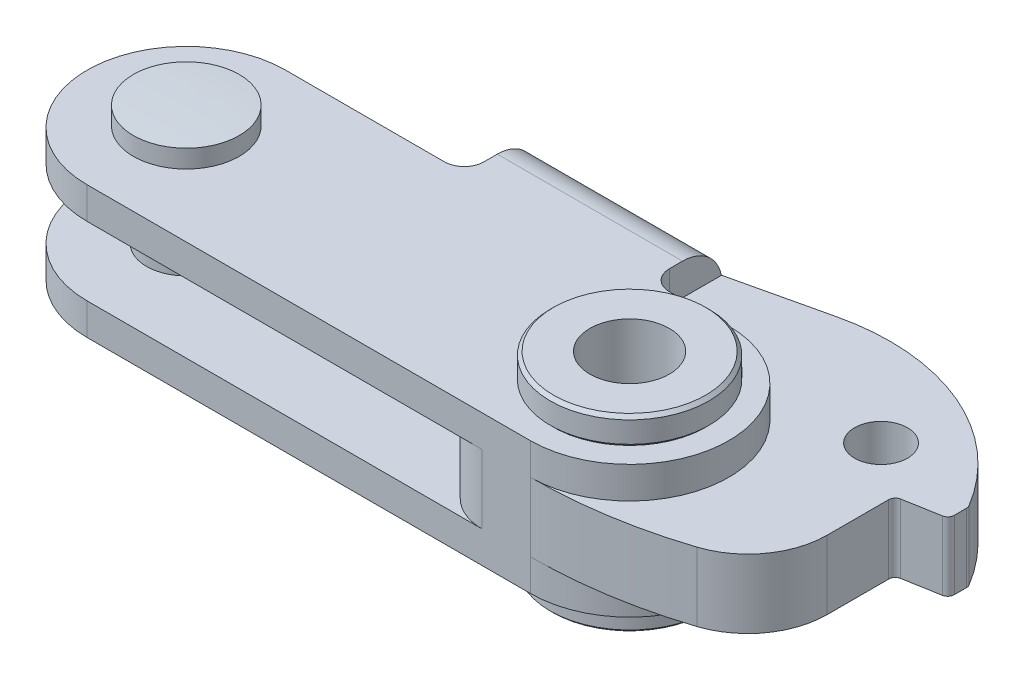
ISO-10303-21;
HEADER;
FILE_DESCRIPTION(('STEP AP214'),'2;1');
FILE_NAME('part.step','',(''),(''),'','','');
FILE_SCHEMA(('AUTOMOTIVE_DESIGN { 1 0 10303 214 1 1 1 1 }'));
ENDSEC;
DATA;
#1=APPLICATION_CONTEXT('core data for automotive mechanical design processes');
#2=APPLICATION_PROTOCOL_DEFINITION('international standard','automotive_design',2000,#1);
#3=PRODUCT_CONTEXT('',#1,'mechanical');
#4=PRODUCT('Part','Part','',(#3));
#5=PRODUCT_RELATED_PRODUCT_CATEGORY('part','',(#4));
#6=PRODUCT_DEFINITION_FORMATION('','',#4);
#7=PRODUCT_DEFINITION_CONTEXT('part definition',#1,'design');
#8=PRODUCT_DEFINITION('design','',#6,#7);
#9=PRODUCT_DEFINITION_SHAPE('','',#8);
#10=(LENGTH_UNIT() NAMED_UNIT(*) SI_UNIT(.MILLI.,.METRE.));
#11=(NAMED_UNIT(*) PLANE_ANGLE_UNIT() SI_UNIT($,.RADIAN.));
#12=(NAMED_UNIT(*) SI_UNIT($,.STERADIAN.) SOLID_ANGLE_UNIT());
#13=UNCERTAINTY_MEASURE_WITH_UNIT(LENGTH_MEASURE(1.E-05),#10,'distance_accuracy_value','');
#14=(GEOMETRIC_REPRESENTATION_CONTEXT(3) GLOBAL_UNCERTAINTY_ASSIGNED_CONTEXT((#13)) GLOBAL_UNIT_ASSIGNED_CONTEXT((#10,
#11,#12)) REPRESENTATION_CONTEXT('',''));
#15=CARTESIAN_POINT('',(0.,0.,0.));
#16=DIRECTION('',(0.,0.,1.));
#17=DIRECTION('',(1.,0.,0.));
#18=AXIS2_PLACEMENT_3D('',#15,#16,#17);
#19=CARTESIAN_POINT('',(27.5,-5.,-9.));
#20=DIRECTION('',(1.,0.,0.));
#21=DIRECTION('',(0.,1.,0.));
#22=AXIS2_PLACEMENT_3D('',#19,#20,#21);
#23=PLANE('',#22);
#24=DIRECTION('',(0.,-1.,0.));
#25=VECTOR('',#24,1.);
#26=CARTESIAN_POINT('',(27.5,0.,-12.950232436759));
#27=LINE('',#26,#25);
#28=CARTESIAN_POINT('',(27.5,2.54417696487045,-12.950232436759));
#29=VERTEX_POINT('',#28);
#30=CARTESIAN_POINT('',(27.5,-2.54417696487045,-12.950232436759));
#31=VERTEX_POINT('',#30);
#32=EDGE_CURVE('E37',#29,#31,#27,.T.);
#33=ORIENTED_EDGE('',*,*,#32,.T.);
#34=CARTESIAN_POINT('',(27.5,-2.00000000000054,-10.0000000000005));
#35=DIRECTION('',(-1.,0.,0.));
#36=DIRECTION('',(0.,0.,1.));
#37=AXIS2_PLACEMENT_3D('',#34,#35,#36);
#38=CIRCLE('',#37,2.99999999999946);
#39=CARTESIAN_POINT('',(27.5,-2.,-13.));
#40=VERTEX_POINT('',#39);
#41=EDGE_CURVE('E622',#40,#31,#38,.T.);
#42=ORIENTED_EDGE('',*,*,#41,.F.);
#43=DIRECTION('',(0.,1.,0.));
#44=VECTOR('',#43,1.);
#45=CARTESIAN_POINT('',(27.5,-5.,-13.));
#46=LINE('',#45,#44);
#47=CARTESIAN_POINT('',(27.5,2.,-13.));
#48=VERTEX_POINT('',#47);
#49=EDGE_CURVE('E683',#40,#48,#46,.T.);
#50=ORIENTED_EDGE('',*,*,#49,.T.);
#51=CARTESIAN_POINT('',(27.5,2.00000000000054,-10.0000000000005));
#52=DIRECTION('',(-1.,0.,0.));
#53=DIRECTION('',(0.,0.,1.));
#54=AXIS2_PLACEMENT_3D('',#51,#52,#53);
#55=CIRCLE('',#54,2.99999999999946);
#56=EDGE_CURVE('E511',#29,#48,#55,.T.);
#57=ORIENTED_EDGE('',*,*,#56,.F.);
#58=EDGE_LOOP('',(#33,#42,#50,#57));
#59=FACE_BOUND('',#58,.T.);
#60=ADVANCED_FACE('F14',(#59),#23,.T.);
#61=DIRECTION('',(0.,0.,-1.));
#62=VECTOR('',#61,1.);
#63=CARTESIAN_POINT('',(27.5,-2.6,-8.99999999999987));
#64=LINE('',#63,#62);
#65=CARTESIAN_POINT('',(27.5,-2.6,-8.99999999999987));
#66=VERTEX_POINT('',#65);
#67=CARTESIAN_POINT('',(27.5,-2.6,-12.9393876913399));
#68=VERTEX_POINT('',#67);
#69=EDGE_CURVE('E29',#66,#68,#64,.T.);
#70=ORIENTED_EDGE('',*,*,#69,.F.);
#71=DIRECTION('',(0.,1.,0.));
#72=VECTOR('',#71,1.);
#73=CARTESIAN_POINT('',(27.5,-5.,-9.));
#74=LINE('',#73,#72);
#75=CARTESIAN_POINT('',(27.5,-5.,-9.));
#76=VERTEX_POINT('',#75);
#77=EDGE_CURVE('E685',#76,#66,#74,.T.);
#78=ORIENTED_EDGE('',*,*,#77,.F.);
#79=DIRECTION('',(0.,0.,-1.));
#80=VECTOR('',#79,1.);
#81=CARTESIAN_POINT('',(27.5,-5.,-9.));
#82=LINE('',#81,#80);
#83=CARTESIAN_POINT('',(27.5,-5.,-10.0000000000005));
#84=VERTEX_POINT('',#83);
#85=EDGE_CURVE('E680',#76,#84,#82,.T.);
#86=ORIENTED_EDGE('',*,*,#85,.T.);
#87=EDGE_CURVE('E510',#68,#84,#38,.T.);
#88=ORIENTED_EDGE('',*,*,#87,.F.);
#89=EDGE_LOOP('',(#70,#78,#86,#88));
#90=FACE_BOUND('',#89,.T.);
#91=ADVANCED_FACE('F460',(#90),#23,.T.);
#92=CARTESIAN_POINT('',(29.8568542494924,0.,7.5));
#93=DIRECTION('',(0.,0.,-1.));
#94=DIRECTION('',(0.,1.,0.));
#95=AXIS2_PLACEMENT_3D('',#92,#93,#94);
#96=PLANE('',#95);
#97=DIRECTION('',(-1.,0.,0.));
#98=VECTOR('',#97,1.);
#99=CARTESIAN_POINT('',(29.8568542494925,2.6,7.5));
#100=LINE('',#99,#98);
#101=CARTESIAN_POINT('',(29.8568542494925,2.6,7.5));
#102=VERTEX_POINT('',#101);
#103=CARTESIAN_POINT('',(0.,2.6,7.5));
#104=VERTEX_POINT('',#103);
#105=EDGE_CURVE('E544',#102,#104,#100,.T.);
#106=ORIENTED_EDGE('',*,*,#105,.F.);
#107=DIRECTION('',(0.,-1.,0.));
#108=VECTOR('',#107,1.);
#109=CARTESIAN_POINT('',(29.8568542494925,0.,7.5));
#110=LINE('',#109,#108);
#111=CARTESIAN_POINT('',(29.8568542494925,-2.6,7.5));
#112=VERTEX_POINT('',#111);
#113=EDGE_CURVE('E417',#102,#112,#110,.T.);
#114=ORIENTED_EDGE('',*,*,#113,.T.);
#115=DIRECTION('',(1.,0.,0.));
#116=VECTOR('',#115,1.);
#117=CARTESIAN_POINT('',(0.,-2.6,7.5));
#118=LINE('',#117,#116);
#119=CARTESIAN_POINT('',(0.,-2.6,7.5));
#120=VERTEX_POINT('',#119);
#121=EDGE_CURVE('E578',#120,#112,#118,.T.);
#122=ORIENTED_EDGE('',*,*,#121,.F.);
#123=DIRECTION('',(0.,1.,0.));
#124=VECTOR('',#123,1.);
#125=CARTESIAN_POINT('',(0.,-5.,7.5));
#126=LINE('',#125,#124);
#127=CARTESIAN_POINT('',(0.,-5.,7.5));
#128=VERTEX_POINT('',#127);
#129=EDGE_CURVE('E328',#128,#120,#126,.T.);
#130=ORIENTED_EDGE('',*,*,#129,.F.);
#131=DIRECTION('',(1.,0.,0.));
#132=VECTOR('',#131,1.);
#133=CARTESIAN_POINT('',(0.,-5.,7.5));
#134=LINE('',#133,#132);
#135=CARTESIAN_POINT('',(33.5,-5.,7.5));
#136=VERTEX_POINT('',#135);
#137=EDGE_CURVE('E671',#128,#136,#134,.T.);
#138=ORIENTED_EDGE('',*,*,#137,.T.);
#139=DIRECTION('',(0.,1.,0.));
#140=VECTOR('',#139,1.);
#141=CARTESIAN_POINT('',(33.5,-5.,7.5));
#142=LINE('',#141,#140);
#143=CARTESIAN_POINT('',(33.5,-2.6,7.5));
#144=VERTEX_POINT('',#143);
#145=EDGE_CURVE('E322',#136,#144,#142,.T.);
#146=ORIENTED_EDGE('',*,*,#145,.T.);
#147=DIRECTION('',(0.,-1.,0.));
#148=VECTOR('',#147,1.);
#149=CARTESIAN_POINT('',(33.5,0.,7.5));
#150=LINE('',#149,#148);
#151=CARTESIAN_POINT('',(33.5,2.6,7.5));
#152=VERTEX_POINT('',#151);
#153=EDGE_CURVE('E415',#152,#144,#150,.T.);
#154=ORIENTED_EDGE('',*,*,#153,.F.);
#155=CARTESIAN_POINT('',(33.5,5.,7.5));
#156=VERTEX_POINT('',#155);
#157=EDGE_CURVE('E319',#152,#156,#142,.T.);
#158=ORIENTED_EDGE('',*,*,#157,.T.);
#159=DIRECTION('',(1.,0.,0.));
#160=VECTOR('',#159,1.);
#161=CARTESIAN_POINT('',(0.,5.,7.5));
#162=LINE('',#161,#160);
#163=CARTESIAN_POINT('',(0.,5.,7.5));
#164=VERTEX_POINT('',#163);
#165=EDGE_CURVE('E646',#164,#156,#162,.T.);
#166=ORIENTED_EDGE('',*,*,#165,.F.);
#167=EDGE_CURVE('E327',#104,#164,#126,.T.);
#168=ORIENTED_EDGE('',*,*,#167,.F.);
#169=EDGE_LOOP('',(#106,#114,#122,#130,#138,#146,#154,#158,#166,#168));
#170=FACE_BOUND('',#169,.T.);
#171=ADVANCED_FACE('F468',(#170),#96,.F.);
#172=CARTESIAN_POINT('',(12.0000000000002,-5.,-8.99999999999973));
#173=DIRECTION('',(0.,1.,0.));
#174=DIRECTION('',(0.,0.,1.));
#175=AXIS2_PLACEMENT_3D('',#172,#173,#174);
#176=CYLINDRICAL_SURFACE('',#175,1.49999999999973);
#177=DIRECTION('',(0.,1.,0.));
#178=VECTOR('',#177,1.);
#179=CARTESIAN_POINT('',(13.5,-5.,-9.));
#180=LINE('',#179,#178);
#181=CARTESIAN_POINT('',(13.5,2.6,-8.99999999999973));
#182=VERTEX_POINT('',#181);
#183=CARTESIAN_POINT('',(13.5,5.,-9.));
#184=VERTEX_POINT('',#183);
#185=EDGE_CURVE('E339',#182,#184,#180,.T.);
#186=ORIENTED_EDGE('',*,*,#185,.F.);
#187=CARTESIAN_POINT('',(12.0000000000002,2.6,-8.99999999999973));
#188=DIRECTION('',(0.,1.,0.));
#189=DIRECTION('',(1.,0.,0.));
#190=AXIS2_PLACEMENT_3D('',#187,#188,#189);
#191=CIRCLE('',#190,1.49999999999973);
#192=CARTESIAN_POINT('',(12.,2.6,-7.5));
#193=VERTEX_POINT('',#192);
#194=EDGE_CURVE('E550',#193,#182,#191,.T.);
#195=ORIENTED_EDGE('',*,*,#194,.F.);
#196=DIRECTION('',(0.,1.,0.));
#197=VECTOR('',#196,1.);
#198=CARTESIAN_POINT('',(12.,-5.,-7.5));
#199=LINE('',#198,#197);
#200=CARTESIAN_POINT('',(12.,5.,-7.5));
#201=VERTEX_POINT('',#200);
#202=EDGE_CURVE('E335',#193,#201,#199,.T.);
#203=ORIENTED_EDGE('',*,*,#202,.T.);
#204=CARTESIAN_POINT('',(12.0000000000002,5.,-8.99999999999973));
#205=DIRECTION('',(0.,-1.,0.));
#206=DIRECTION('',(0.,0.,-1.));
#207=AXIS2_PLACEMENT_3D('',#204,#205,#206);
#208=CIRCLE('',#207,1.49999999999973);
#209=EDGE_CURVE('E637',#184,#201,#208,.T.);
#210=ORIENTED_EDGE('',*,*,#209,.F.);
#211=EDGE_LOOP('',(#186,#195,#203,#210));
#212=FACE_BOUND('',#211,.T.);
#213=ADVANCED_FACE('F794',(#212),#176,.F.);
#214=CARTESIAN_POINT('',(12.,-5.,-7.5));
#215=DIRECTION('',(0.,0.,-1.));
#216=DIRECTION('',(0.,1.,0.));
#217=AXIS2_PLACEMENT_3D('',#214,#215,#216);
#218=PLANE('',#217);
#219=ORIENTED_EDGE('',*,*,#202,.F.);
#220=DIRECTION('',(1.,0.,0.));
#221=VECTOR('',#220,1.);
#222=CARTESIAN_POINT('',(0.,2.6,-7.5));
#223=LINE('',#222,#221);
#224=CARTESIAN_POINT('',(0.,2.6,-7.5));
#225=VERTEX_POINT('',#224);
#226=EDGE_CURVE('E548',#225,#193,#223,.T.);
#227=ORIENTED_EDGE('',*,*,#226,.F.);
#228=DIRECTION('',(0.,1.,0.));
#229=VECTOR('',#228,1.);
#230=CARTESIAN_POINT('',(0.,-5.,-7.5));
#231=LINE('',#230,#229);
#232=CARTESIAN_POINT('',(0.,5.,-7.5));
#233=VERTEX_POINT('',#232);
#234=EDGE_CURVE('E331',#225,#233,#231,.T.);
#235=ORIENTED_EDGE('',*,*,#234,.T.);
#236=DIRECTION('',(-1.,0.,0.));
#237=VECTOR('',#236,1.);
#238=CARTESIAN_POINT('',(12.,5.,-7.5));
#239=LINE('',#238,#237);
#240=EDGE_CURVE('E640',#201,#233,#239,.T.);
#241=ORIENTED_EDGE('',*,*,#240,.F.);
#242=EDGE_LOOP('',(#219,#227,#235,#241));
#243=FACE_BOUND('',#242,.T.);
#244=ADVANCED_FACE('F799',(#243),#218,.T.);
#245=CARTESIAN_POINT('',(0.,-5.,0.));
#246=DIRECTION('',(0.,1.,0.));
#247=DIRECTION('',(0.,0.,1.));
#248=AXIS2_PLACEMENT_3D('',#245,#246,#247);
#249=CYLINDRICAL_SURFACE('',#248,7.5);
#250=ORIENTED_EDGE('',*,*,#234,.F.);
#251=CARTESIAN_POINT('',(0.,2.6,0.));
#252=DIRECTION('',(0.,-1.,0.));
#253=DIRECTION('',(1.,0.,0.));
#254=AXIS2_PLACEMENT_3D('',#251,#252,#253);
#255=CIRCLE('',#254,7.5);
#256=EDGE_CURVE('E546',#104,#225,#255,.T.);
#257=ORIENTED_EDGE('',*,*,#256,.F.);
#258=ORIENTED_EDGE('',*,*,#167,.T.);
#259=CARTESIAN_POINT('',(0.,5.,0.));
#260=DIRECTION('',(0.,1.,0.));
#261=DIRECTION('',(0.,0.,-1.));
#262=AXIS2_PLACEMENT_3D('',#259,#260,#261);
#263=CIRCLE('',#262,7.5);
#264=EDGE_CURVE('E643',#233,#164,#263,.T.);
#265=ORIENTED_EDGE('',*,*,#264,.F.);
#266=EDGE_LOOP('',(#250,#257,#258,#265));
#267=FACE_BOUND('',#266,.T.);
#268=ADVANCED_FACE('F804',(#267),#249,.T.);
#269=ORIENTED_EDGE('',*,*,#129,.T.);
#270=CARTESIAN_POINT('',(0.,-2.6,0.));
#271=DIRECTION('',(0.,1.,0.));
#272=DIRECTION('',(0.,0.,1.));
#273=AXIS2_PLACEMENT_3D('',#270,#271,#272);
#274=CIRCLE('',#273,7.5);
#275=CARTESIAN_POINT('',(0.,-2.6,-7.5));
#276=VERTEX_POINT('',#275);
#277=EDGE_CURVE('E576',#276,#120,#274,.T.);
#278=ORIENTED_EDGE('',*,*,#277,.F.);
#279=CARTESIAN_POINT('',(0.,-5.,-7.5));
#280=VERTEX_POINT('',#279);
#281=EDGE_CURVE('E332',#280,#276,#231,.T.);
#282=ORIENTED_EDGE('',*,*,#281,.F.);
#283=CARTESIAN_POINT('',(0.,-5.,0.));
#284=DIRECTION('',(0.,1.,0.));
#285=DIRECTION('',(0.,0.,-1.));
#286=AXIS2_PLACEMENT_3D('',#283,#284,#285);
#287=CIRCLE('',#286,7.5);
#288=EDGE_CURVE('E668',#280,#128,#287,.T.);
#289=ORIENTED_EDGE('',*,*,#288,.T.);
#290=EDGE_LOOP('',(#269,#278,#282,#289));
#291=FACE_BOUND('',#290,.T.);
#292=ADVANCED_FACE('F974',(#291),#249,.T.);
#293=ORIENTED_EDGE('',*,*,#281,.T.);
#294=DIRECTION('',(-1.,0.,0.));
#295=VECTOR('',#294,1.);
#296=CARTESIAN_POINT('',(12.,-2.6,-7.5));
#297=LINE('',#296,#295);
#298=CARTESIAN_POINT('',(12.,-2.6,-7.5));
#299=VERTEX_POINT('',#298);
#300=EDGE_CURVE('E574',#299,#276,#297,.T.);
#301=ORIENTED_EDGE('',*,*,#300,.F.);
#302=CARTESIAN_POINT('',(12.,-5.,-7.5));
#303=VERTEX_POINT('',#302);
#304=EDGE_CURVE('E336',#303,#299,#199,.T.);
#305=ORIENTED_EDGE('',*,*,#304,.F.);
#306=DIRECTION('',(-1.,0.,0.));
#307=VECTOR('',#306,1.);
#308=CARTESIAN_POINT('',(12.,-5.,-7.5));
#309=LINE('',#308,#307);
#310=EDGE_CURVE('E665',#303,#280,#309,.T.);
#311=ORIENTED_EDGE('',*,*,#310,.T.);
#312=EDGE_LOOP('',(#293,#301,#305,#311));
#313=FACE_BOUND('',#312,.T.);
#314=ADVANCED_FACE('F971',(#313),#218,.T.);
#315=ORIENTED_EDGE('',*,*,#304,.T.);
#316=CARTESIAN_POINT('',(12.0000000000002,-2.6,-8.99999999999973));
#317=DIRECTION('',(0.,-1.,0.));
#318=DIRECTION('',(0.,0.,1.));
#319=AXIS2_PLACEMENT_3D('',#316,#317,#318);
#320=CIRCLE('',#319,1.49999999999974);
#321=CARTESIAN_POINT('',(13.5,-2.6,-9.));
#322=VERTEX_POINT('',#321);
#323=EDGE_CURVE('E572',#322,#299,#320,.T.);
#324=ORIENTED_EDGE('',*,*,#323,.F.);
#325=CARTESIAN_POINT('',(13.5,-5.,-9.));
#326=VERTEX_POINT('',#325);
#327=EDGE_CURVE('E340',#326,#322,#180,.T.);
#328=ORIENTED_EDGE('',*,*,#327,.F.);
#329=CARTESIAN_POINT('',(12.0000000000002,-5.,-8.99999999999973));
#330=DIRECTION('',(0.,-1.,0.));
#331=DIRECTION('',(0.,0.,-1.));
#332=AXIS2_PLACEMENT_3D('',#329,#330,#331);
#333=CIRCLE('',#332,1.49999999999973);
#334=EDGE_CURVE('E662',#326,#303,#333,.T.);
#335=ORIENTED_EDGE('',*,*,#334,.T.);
#336=EDGE_LOOP('',(#315,#324,#328,#335));
#337=FACE_BOUND('',#336,.T.);
#338=ADVANCED_FACE('F854',(#337),#176,.F.);
#339=CARTESIAN_POINT('',(38.2000000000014,0.,0.999999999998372));
#340=DIRECTION('',(0.,-1.,0.));
#341=DIRECTION('',(0.,0.,-1.));
#342=AXIS2_PLACEMENT_3D('',#339,#340,#341);
#343=CYLINDRICAL_SURFACE('',#342,15.9999999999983);
#344=DIRECTION('',(0.,-1.,0.));
#345=VECTOR('',#344,1.);
#346=CARTESIAN_POINT('',(51.929032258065,0.,-7.2166704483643));
#347=LINE('',#346,#345);
#348=CARTESIAN_POINT('',(51.929032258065,2.6,-7.2166704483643));
#349=VERTEX_POINT('',#348);
#350=CARTESIAN_POINT('',(51.929032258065,-2.6,-7.2166704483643));
#351=VERTEX_POINT('',#350);
#352=EDGE_CURVE('E431',#349,#351,#347,.T.);
#353=ORIENTED_EDGE('',*,*,#352,.T.);
#354=CARTESIAN_POINT('',(38.2000000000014,-2.6,0.999999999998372));
#355=DIRECTION('',(0.,-1.,0.));
#356=DIRECTION('',(0.,0.,-1.));
#357=AXIS2_PLACEMENT_3D('',#354,#355,#356);
#358=CIRCLE('',#357,15.9999999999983);
#359=CARTESIAN_POINT('',(34.5000000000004,-2.6,-14.566309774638));
#360=VERTEX_POINT('',#359);
#361=EDGE_CURVE('E747',#360,#351,#358,.T.);
#362=ORIENTED_EDGE('',*,*,#361,.F.);
#363=DIRECTION('',(0.,-1.,0.));
#364=VECTOR('',#363,1.);
#365=CARTESIAN_POINT('',(34.5000000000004,0.,-14.566309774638));
#366=LINE('',#365,#364);
#367=CARTESIAN_POINT('',(34.5000000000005,2.6,-14.566309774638));
#368=VERTEX_POINT('',#367);
#369=EDGE_CURVE('E429',#368,#360,#366,.T.);
#370=ORIENTED_EDGE('',*,*,#369,.F.);
#371=CARTESIAN_POINT('',(38.2000000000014,2.6,0.999999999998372));
#372=DIRECTION('',(0.,1.,0.));
#373=DIRECTION('',(0.,0.,1.));
#374=AXIS2_PLACEMENT_3D('',#371,#372,#373);
#375=CIRCLE('',#374,15.9999999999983);
#376=EDGE_CURVE('E736',#349,#368,#375,.T.);
#377=ORIENTED_EDGE('',*,*,#376,.F.);
#378=EDGE_LOOP('',(#353,#362,#370,#377));
#379=FACE_BOUND('',#378,.T.);
#380=ADVANCED_FACE('F752',(#379),#343,.T.);
#381=CARTESIAN_POINT('',(34.5000000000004,0.,-14.566309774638));
#382=DIRECTION('',(0.224951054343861,0.,0.974370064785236));
#383=DIRECTION('',(0.974370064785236,0.,-0.224951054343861));
#384=AXIS2_PLACEMENT_3D('',#381,#382,#383);
#385=PLANE('',#384);
#386=ORIENTED_EDGE('',*,*,#369,.T.);
#387=DIRECTION('',(0.974370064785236,0.,-0.224951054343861));
#388=VECTOR('',#387,1.);
#389=CARTESIAN_POINT('',(27.5,-2.6,-12.950232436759));
#390=LINE('',#389,#388);
#391=CARTESIAN_POINT('',(27.5,-2.6,-12.950232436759));
#392=VERTEX_POINT('',#391);
#393=EDGE_CURVE('E743',#392,#360,#390,.T.);
#394=ORIENTED_EDGE('',*,*,#393,.F.);
#395=DIRECTION('',(0.,1.,0.));
#396=VECTOR('',#395,1.);
#397=CARTESIAN_POINT('',(27.5,-2.6,-12.950232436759));
#398=LINE('',#397,#396);
#399=EDGE_CURVE('E708',#392,#31,#398,.T.);
#400=ORIENTED_EDGE('',*,*,#399,.T.);
#401=ORIENTED_EDGE('',*,*,#32,.F.);
#402=DIRECTION('',(0.,-1.,0.));
#403=VECTOR('',#402,1.);
#404=CARTESIAN_POINT('',(27.5,2.6,-12.950232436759));
#405=LINE('',#404,#403);
#406=CARTESIAN_POINT('',(27.5,2.6,-12.950232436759));
#407=VERTEX_POINT('',#406);
#408=EDGE_CURVE('E516',#407,#29,#405,.T.);
#409=ORIENTED_EDGE('',*,*,#408,.F.);
#410=DIRECTION('',(-0.974370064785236,0.,0.224951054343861));
#411=VECTOR('',#410,1.);
#412=CARTESIAN_POINT('',(34.5000000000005,2.6,-14.566309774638));
#413=LINE('',#412,#411);
#414=EDGE_CURVE('E500',#368,#407,#413,.T.);
#415=ORIENTED_EDGE('',*,*,#414,.F.);
#416=EDGE_LOOP('',(#386,#394,#400,#401,#409,#415));
#417=FACE_BOUND('',#416,.T.);
#418=ADVANCED_FACE('F740',(#417),#385,.F.);
#419=CARTESIAN_POINT('',(27.5,0.,-10.));
#420=DIRECTION('',(0.,0.,1.));
#421=DIRECTION('',(0.,-1.,0.));
#422=AXIS2_PLACEMENT_3D('',#419,#420,#421);
#423=PLANE('',#422);
#424=DIRECTION('',(-1.,0.,0.));
#425=VECTOR('',#424,1.);
#426=CARTESIAN_POINT('',(27.5,2.5,-10.));
#427=LINE('',#426,#425);
#428=CARTESIAN_POINT('',(27.49,2.5,-10.));
#429=VERTEX_POINT('',#428);
#430=CARTESIAN_POINT('',(15.5,2.5,-10.));
#431=VERTEX_POINT('',#430);
#432=EDGE_CURVE('E396',#429,#431,#427,.T.);
#433=ORIENTED_EDGE('',*,*,#432,.F.);
#434=DIRECTION('',(0.,1.,0.));
#435=VECTOR('',#434,1.);
#436=CARTESIAN_POINT('',(27.49,-2.5,-10.));
#437=LINE('',#436,#435);
#438=CARTESIAN_POINT('',(27.49,-2.5,-10.));
#439=VERTEX_POINT('',#438);
#440=EDGE_CURVE('E352',#439,#429,#437,.T.);
#441=ORIENTED_EDGE('',*,*,#440,.F.);
#442=DIRECTION('',(-1.,0.,0.));
#443=VECTOR('',#442,1.);
#444=CARTESIAN_POINT('',(27.5,-2.5,-10.));
#445=LINE('',#444,#443);
#446=CARTESIAN_POINT('',(15.5,-2.5,-10.));
#447=VERTEX_POINT('',#446);
#448=EDGE_CURVE('E397',#439,#447,#445,.T.);
#449=ORIENTED_EDGE('',*,*,#448,.T.);
#450=DIRECTION('',(0.,-1.,0.));
#451=VECTOR('',#450,1.);
#452=CARTESIAN_POINT('',(15.5,0.,-10.));
#453=LINE('',#452,#451);
#454=EDGE_CURVE('E425',#431,#447,#453,.T.);
#455=ORIENTED_EDGE('',*,*,#454,.F.);
#456=EDGE_LOOP('',(#433,#441,#449,#455));
#457=FACE_BOUND('',#456,.T.);
#458=ADVANCED_FACE('F857',(#457),#423,.F.);
#459=CARTESIAN_POINT('',(15.5,0.,-10.));
#460=DIRECTION('',(1.,0.,0.));
#461=DIRECTION('',(0.,1.,0.));
#462=AXIS2_PLACEMENT_3D('',#459,#460,#461);
#463=PLANE('',#462);
#464=ORIENTED_EDGE('',*,*,#454,.T.);
#465=DIRECTION('',(0.,1.,0.));
#466=VECTOR('',#465,1.);
#467=CARTESIAN_POINT('',(15.5,-2.6,-10.));
#468=LINE('',#467,#466);
#469=CARTESIAN_POINT('',(15.5,-2.6,-10.));
#470=VERTEX_POINT('',#469);
#471=EDGE_CURVE('E587',#470,#447,#468,.T.);
#472=ORIENTED_EDGE('',*,*,#471,.F.);
#473=DIRECTION('',(0.,0.,-1.));
#474=VECTOR('',#473,1.);
#475=CARTESIAN_POINT('',(15.5,-2.6,-6.8568542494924));
#476=LINE('',#475,#474);
#477=CARTESIAN_POINT('',(15.5,-2.6,-6.8568542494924));
#478=VERTEX_POINT('',#477);
#479=EDGE_CURVE('E565',#478,#470,#476,.T.);
#480=ORIENTED_EDGE('',*,*,#479,.F.);
#481=DIRECTION('',(0.,-1.,0.));
#482=VECTOR('',#481,1.);
#483=CARTESIAN_POINT('',(15.5,0.,-6.8568542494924));
#484=LINE('',#483,#482);
#485=CARTESIAN_POINT('',(15.5,2.6,-6.8568542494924));
#486=VERTEX_POINT('',#485);
#487=EDGE_CURVE('E423',#486,#478,#484,.T.);
#488=ORIENTED_EDGE('',*,*,#487,.F.);
#489=DIRECTION('',(0.,0.,1.));
#490=VECTOR('',#489,1.);
#491=CARTESIAN_POINT('',(15.5,2.6,-10.));
#492=LINE('',#491,#490);
#493=CARTESIAN_POINT('',(15.5,2.6,-10.));
#494=VERTEX_POINT('',#493);
#495=EDGE_CURVE('E532',#494,#486,#492,.T.);
#496=ORIENTED_EDGE('',*,*,#495,.F.);
#497=DIRECTION('',(0.,-1.,0.));
#498=VECTOR('',#497,1.);
#499=CARTESIAN_POINT('',(15.5,2.6,-10.));
#500=LINE('',#499,#498);
#501=EDGE_CURVE('E555',#494,#431,#500,.T.);
#502=ORIENTED_EDGE('',*,*,#501,.T.);
#503=EDGE_LOOP('',(#464,#472,#480,#488,#496,#502));
#504=FACE_BOUND('',#503,.T.);
#505=ADVANCED_FACE('F860',(#504),#463,.F.);
#506=CARTESIAN_POINT('',(19.5000000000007,0.,-6.85685424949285));
#507=DIRECTION('',(0.,-1.,0.));
#508=DIRECTION('',(0.,0.,-1.));
#509=AXIS2_PLACEMENT_3D('',#506,#507,#508);
#510=CYLINDRICAL_SURFACE('',#509,4.00000000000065);
#511=ORIENTED_EDGE('',*,*,#487,.T.);
#512=CARTESIAN_POINT('',(19.5000000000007,-2.6,-6.85685424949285));
#513=DIRECTION('',(0.,-1.,0.));
#514=DIRECTION('',(0.,0.,1.));
#515=AXIS2_PLACEMENT_3D('',#512,#513,#514);
#516=CIRCLE('',#515,4.00000000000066);
#517=CARTESIAN_POINT('',(16.671572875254,-2.6,-4.0284271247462));
#518=VERTEX_POINT('',#517);
#519=EDGE_CURVE('E562',#518,#478,#516,.T.);
#520=ORIENTED_EDGE('',*,*,#519,.F.);
#521=DIRECTION('',(0.,-1.,0.));
#522=VECTOR('',#521,1.);
#523=CARTESIAN_POINT('',(16.671572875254,0.,-4.0284271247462));
#524=LINE('',#523,#522);
#525=CARTESIAN_POINT('',(16.671572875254,2.6,-4.0284271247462));
#526=VERTEX_POINT('',#525);
#527=EDGE_CURVE('E421',#526,#518,#524,.T.);
#528=ORIENTED_EDGE('',*,*,#527,.F.);
#529=CARTESIAN_POINT('',(19.5000000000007,2.6,-6.85685424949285));
#530=DIRECTION('',(0.,1.,0.));
#531=DIRECTION('',(1.,0.,0.));
#532=AXIS2_PLACEMENT_3D('',#529,#530,#531);
#533=CIRCLE('',#532,4.00000000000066);
#534=EDGE_CURVE('E535',#486,#526,#533,.T.);
#535=ORIENTED_EDGE('',*,*,#534,.F.);
#536=EDGE_LOOP('',(#511,#520,#528,#535));
#537=FACE_BOUND('',#536,.T.);
#538=ADVANCED_FACE('F864',(#537),#510,.T.);
#539=CARTESIAN_POINT('',(16.671572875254,0.,-4.0284271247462));
#540=DIRECTION('',(0.707106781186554,0.,-0.707106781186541));
#541=DIRECTION('',(-0.707106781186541,0.,-0.707106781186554));
#542=AXIS2_PLACEMENT_3D('',#539,#540,#541);
#543=PLANE('',#542);
#544=ORIENTED_EDGE('',*,*,#527,.T.);
#545=DIRECTION('',(-0.707106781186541,0.,-0.707106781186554));
#546=VECTOR('',#545,1.);
#547=CARTESIAN_POINT('',(27.0284271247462,-2.6,6.3284271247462));
#548=LINE('',#547,#546);
#549=CARTESIAN_POINT('',(27.0284271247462,-2.6,6.3284271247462));
#550=VERTEX_POINT('',#549);
#551=EDGE_CURVE('E584',#550,#518,#548,.T.);
#552=ORIENTED_EDGE('',*,*,#551,.F.);
#553=DIRECTION('',(0.,-1.,0.));
#554=VECTOR('',#553,1.);
#555=CARTESIAN_POINT('',(27.0284271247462,0.,6.3284271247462));
#556=LINE('',#555,#554);
#557=CARTESIAN_POINT('',(27.0284271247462,2.6,6.3284271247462));
#558=VERTEX_POINT('',#557);
#559=EDGE_CURVE('E419',#558,#550,#556,.T.);
#560=ORIENTED_EDGE('',*,*,#559,.F.);
#561=DIRECTION('',(0.707106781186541,0.,0.707106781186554));
#562=VECTOR('',#561,1.);
#563=CARTESIAN_POINT('',(16.671572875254,2.6,-4.0284271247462));
#564=LINE('',#563,#562);
#565=EDGE_CURVE('E538',#526,#558,#564,.T.);
#566=ORIENTED_EDGE('',*,*,#565,.F.);
#567=EDGE_LOOP('',(#544,#552,#560,#566));
#568=FACE_BOUND('',#567,.T.);
#569=ADVANCED_FACE('F868',(#568),#543,.F.);
#570=CARTESIAN_POINT('',(29.8568542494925,0.,3.49999999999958));
#571=DIRECTION('',(0.,-1.,0.));
#572=DIRECTION('',(0.,0.,-1.));
#573=AXIS2_PLACEMENT_3D('',#570,#571,#572);
#574=CYLINDRICAL_SURFACE('',#573,4.00000000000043);
#575=ORIENTED_EDGE('',*,*,#559,.T.);
#576=CARTESIAN_POINT('',(29.8568542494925,-2.6,3.49999999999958));
#577=DIRECTION('',(0.,-1.,0.));
#578=DIRECTION('',(0.,0.,1.));
#579=AXIS2_PLACEMENT_3D('',#576,#577,#578);
#580=CIRCLE('',#579,4.00000000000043);
#581=EDGE_CURVE('E581',#112,#550,#580,.T.);
#582=ORIENTED_EDGE('',*,*,#581,.F.);
#583=ORIENTED_EDGE('',*,*,#113,.F.);
#584=CARTESIAN_POINT('',(29.8568542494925,2.6,3.49999999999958));
#585=DIRECTION('',(0.,1.,0.));
#586=DIRECTION('',(1.,0.,0.));
#587=AXIS2_PLACEMENT_3D('',#584,#585,#586);
#588=CIRCLE('',#587,4.00000000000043);
#589=EDGE_CURVE('E541',#558,#102,#588,.T.);
#590=ORIENTED_EDGE('',*,*,#589,.F.);
#591=EDGE_LOOP('',(#575,#582,#583,#590));
#592=FACE_BOUND('',#591,.T.);
#593=ADVANCED_FACE('F872',(#592),#574,.T.);
#594=CARTESIAN_POINT('',(33.5000000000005,0.,-27.4999999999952));
#595=DIRECTION('',(0.,-1.,0.));
#596=DIRECTION('',(0.,0.,-1.));
#597=AXIS2_PLACEMENT_3D('',#594,#595,#596);
#598=CYLINDRICAL_SURFACE('',#597,34.9999999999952);
#599=ORIENTED_EDGE('',*,*,#153,.T.);
#600=CARTESIAN_POINT('',(33.5000000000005,-2.6,-27.4999999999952));
#601=DIRECTION('',(0.,-1.,0.));
#602=DIRECTION('',(0.,0.,-1.));
#603=AXIS2_PLACEMENT_3D('',#600,#601,#602);
#604=CIRCLE('',#603,34.9999999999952);
#605=CARTESIAN_POINT('',(44.362068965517,-2.6,5.7718418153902));
#606=VERTEX_POINT('',#605);
#607=EDGE_CURVE('E300',#606,#144,#604,.T.);
#608=ORIENTED_EDGE('',*,*,#607,.F.);
#609=DIRECTION('',(0.,-1.,0.));
#610=VECTOR('',#609,1.);
#611=CARTESIAN_POINT('',(44.362068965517,0.,5.7718418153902));
#612=LINE('',#611,#610);
#613=CARTESIAN_POINT('',(44.362068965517,2.6,5.7718418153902));
#614=VERTEX_POINT('',#613);
#615=EDGE_CURVE('E413',#614,#606,#612,.T.);
#616=ORIENTED_EDGE('',*,*,#615,.F.);
#617=CARTESIAN_POINT('',(33.5000000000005,2.6,-27.4999999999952));
#618=DIRECTION('',(0.,1.,0.));
#619=DIRECTION('',(0.,0.,1.));
#620=AXIS2_PLACEMENT_3D('',#617,#618,#619);
#621=CIRCLE('',#620,34.9999999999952);
#622=EDGE_CURVE('E713',#152,#614,#621,.T.);
#623=ORIENTED_EDGE('',*,*,#622,.F.);
#624=EDGE_LOOP('',(#599,#608,#616,#623));
#625=FACE_BOUND('',#624,.T.);
#626=ADVANCED_FACE('F815',(#625),#598,.T.);
#627=CARTESIAN_POINT('',(42.4999999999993,0.,0.0680975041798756));
#628=DIRECTION('',(0.,-1.,0.));
#629=DIRECTION('',(0.,0.,-1.));
#630=AXIS2_PLACEMENT_3D('',#627,#628,#629);
#631=CYLINDRICAL_SURFACE('',#630,6.00000000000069);
#632=ORIENTED_EDGE('',*,*,#615,.T.);
#633=CARTESIAN_POINT('',(42.4999999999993,-2.6,0.0680975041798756));
#634=DIRECTION('',(0.,-1.,0.));
#635=DIRECTION('',(0.,0.,-1.));
#636=AXIS2_PLACEMENT_3D('',#633,#634,#635);
#637=CIRCLE('',#636,6.00000000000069);
#638=CARTESIAN_POINT('',(48.5,-2.6,0.0680975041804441));
#639=VERTEX_POINT('',#638);
#640=EDGE_CURVE('E773',#639,#606,#637,.T.);
#641=ORIENTED_EDGE('',*,*,#640,.F.);
#642=DIRECTION('',(0.,-1.,0.));
#643=VECTOR('',#642,1.);
#644=CARTESIAN_POINT('',(48.5,0.,0.0680975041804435));
#645=LINE('',#644,#643);
#646=CARTESIAN_POINT('',(48.5,2.6,0.0680975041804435));
#647=VERTEX_POINT('',#646);
#648=EDGE_CURVE('E411',#647,#639,#645,.T.);
#649=ORIENTED_EDGE('',*,*,#648,.F.);
#650=CARTESIAN_POINT('',(42.4999999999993,2.6,0.0680975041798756));
#651=DIRECTION('',(0.,1.,0.));
#652=DIRECTION('',(0.,0.,1.));
#653=AXIS2_PLACEMENT_3D('',#650,#651,#652);
#654=CIRCLE('',#653,6.00000000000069);
#655=EDGE_CURVE('E716',#614,#647,#654,.T.);
#656=ORIENTED_EDGE('',*,*,#655,.F.);
#657=EDGE_LOOP('',(#632,#641,#649,#656));
#658=FACE_BOUND('',#657,.T.);
#659=ADVANCED_FACE('F818',(#658),#631,.T.);
#660=CARTESIAN_POINT('',(48.5,0.,0.068097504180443));
#661=DIRECTION('',(-1.,0.,0.));
#662=DIRECTION('',(0.,-1.,0.));
#663=AXIS2_PLACEMENT_3D('',#660,#661,#662);
#664=PLANE('',#663);
#665=ORIENTED_EDGE('',*,*,#648,.T.);
#666=DIRECTION('',(0.,0.,1.));
#667=VECTOR('',#666,1.);
#668=CARTESIAN_POINT('',(48.5,-2.6,-4.5804501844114));
#669=LINE('',#668,#667);
#670=CARTESIAN_POINT('',(48.5,-2.6,-4.5804501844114));
#671=VERTEX_POINT('',#670);
#672=EDGE_CURVE('E770',#671,#639,#669,.T.);
#673=ORIENTED_EDGE('',*,*,#672,.F.);
#674=DIRECTION('',(0.,-1.,0.));
#675=VECTOR('',#674,1.);
#676=CARTESIAN_POINT('',(48.5,0.,-4.5804501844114));
#677=LINE('',#676,#675);
#678=CARTESIAN_POINT('',(48.5,2.6,-4.5804501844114));
#679=VERTEX_POINT('',#678);
#680=EDGE_CURVE('E409',#679,#671,#677,.T.);
#681=ORIENTED_EDGE('',*,*,#680,.F.);
#682=DIRECTION('',(0.,0.,-1.));
#683=VECTOR('',#682,1.);
#684=CARTESIAN_POINT('',(48.5,2.6,0.0680975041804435));
#685=LINE('',#684,#683);
#686=EDGE_CURVE('E719',#647,#679,#685,.T.);
#687=ORIENTED_EDGE('',*,*,#686,.F.);
#688=EDGE_LOOP('',(#665,#673,#681,#687));
#689=FACE_BOUND('',#688,.T.);
#690=ADVANCED_FACE('F822',(#689),#664,.F.);
#691=CARTESIAN_POINT('',(49.0000000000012,0.,-4.58045018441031));
#692=DIRECTION('',(0.,-1.,0.));
#693=DIRECTION('',(0.,0.,-1.));
#694=AXIS2_PLACEMENT_3D('',#691,#692,#693);
#695=CYLINDRICAL_SURFACE('',#694,0.500000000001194);
#696=ORIENTED_EDGE('',*,*,#680,.T.);
#697=CARTESIAN_POINT('',(49.0000000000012,-2.6,-4.58045018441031));
#698=DIRECTION('',(0.,1.,0.));
#699=DIRECTION('',(0.,0.,-1.));
#700=AXIS2_PLACEMENT_3D('',#697,#698,#699);
#701=CIRCLE('',#700,0.5000000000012);
#702=CARTESIAN_POINT('',(48.913175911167,-2.6,-5.0728540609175));
#703=VERTEX_POINT('',#702);
#704=EDGE_CURVE('E767',#703,#671,#701,.T.);
#705=ORIENTED_EDGE('',*,*,#704,.F.);
#706=DIRECTION('',(0.,-1.,0.));
#707=VECTOR('',#706,1.);
#708=CARTESIAN_POINT('',(48.913175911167,0.,-5.0728540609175));
#709=LINE('',#708,#707);
#710=CARTESIAN_POINT('',(48.913175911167,2.6,-5.0728540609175));
#711=VERTEX_POINT('',#710);
#712=EDGE_CURVE('E407',#711,#703,#709,.T.);
#713=ORIENTED_EDGE('',*,*,#712,.F.);
#714=CARTESIAN_POINT('',(49.0000000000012,2.6,-4.58045018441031));
#715=DIRECTION('',(0.,-1.,0.));
#716=DIRECTION('',(0.,0.,1.));
#717=AXIS2_PLACEMENT_3D('',#714,#715,#716);
#718=CIRCLE('',#717,0.5000000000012);
#719=EDGE_CURVE('E722',#679,#711,#718,.T.);
#720=ORIENTED_EDGE('',*,*,#719,.F.);
#721=EDGE_LOOP('',(#696,#705,#713,#720));
#722=FACE_BOUND('',#721,.T.);
#723=ADVANCED_FACE('F827',(#722),#695,.F.);
#724=CARTESIAN_POINT('',(48.913175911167,0.,-5.0728540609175));
#725=DIRECTION('',(-0.173648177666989,0.,-0.984807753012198));
#726=DIRECTION('',(-0.984807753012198,0.,0.173648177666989));
#727=AXIS2_PLACEMENT_3D('',#724,#725,#726);
#728=PLANE('',#727);
#729=ORIENTED_EDGE('',*,*,#712,.T.);
#730=DIRECTION('',(-0.984807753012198,0.,0.173648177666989));
#731=VECTOR('',#730,1.);
#732=CARTESIAN_POINT('',(51.586824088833,-2.6,-5.5442903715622));
#733=LINE('',#732,#731);
#734=CARTESIAN_POINT('',(51.586824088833,-2.6,-5.5442903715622));
#735=VERTEX_POINT('',#734);
#736=EDGE_CURVE('E764',#735,#703,#733,.T.);
#737=ORIENTED_EDGE('',*,*,#736,.F.);
#738=DIRECTION('',(0.,-1.,0.));
#739=VECTOR('',#738,1.);
#740=CARTESIAN_POINT('',(51.586824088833,0.,-5.5442903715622));
#741=LINE('',#740,#739);
#742=CARTESIAN_POINT('',(51.586824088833,2.6,-5.5442903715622));
#743=VERTEX_POINT('',#742);
#744=EDGE_CURVE('E405',#743,#735,#741,.T.);
#745=ORIENTED_EDGE('',*,*,#744,.F.);
#746=DIRECTION('',(0.984807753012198,0.,-0.173648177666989));
#747=VECTOR('',#746,1.);
#748=CARTESIAN_POINT('',(48.913175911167,2.6,-5.0728540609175));
#749=LINE('',#748,#747);
#750=EDGE_CURVE('E725',#711,#743,#749,.T.);
#751=ORIENTED_EDGE('',*,*,#750,.F.);
#752=EDGE_LOOP('',(#729,#737,#745,#751));
#753=FACE_BOUND('',#752,.T.);
#754=ADVANCED_FACE('F830',(#753),#728,.F.);
#755=CARTESIAN_POINT('',(51.499999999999,0.,-6.03669424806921));
#756=DIRECTION('',(0.,-1.,0.));
#757=DIRECTION('',(0.,0.,-1.));
#758=AXIS2_PLACEMENT_3D('',#755,#756,#757);
#759=CYLINDRICAL_SURFACE('',#758,0.500000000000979);
#760=ORIENTED_EDGE('',*,*,#744,.T.);
#761=CARTESIAN_POINT('',(51.499999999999,-2.6,-6.03669424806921));
#762=DIRECTION('',(0.,-1.,0.));
#763=DIRECTION('',(0.,0.,-1.));
#764=AXIS2_PLACEMENT_3D('',#761,#762,#763);
#765=CIRCLE('',#764,0.500000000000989);
#766=CARTESIAN_POINT('',(52.,-2.6,-6.0366942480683));
#767=VERTEX_POINT('',#766);
#768=EDGE_CURVE('E761',#767,#735,#765,.T.);
#769=ORIENTED_EDGE('',*,*,#768,.F.);
#770=DIRECTION('',(0.,-1.,0.));
#771=VECTOR('',#770,1.);
#772=CARTESIAN_POINT('',(52.,0.,-6.0366942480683));
#773=LINE('',#772,#771);
#774=CARTESIAN_POINT('',(52.,2.6,-6.0366942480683));
#775=VERTEX_POINT('',#774);
#776=EDGE_CURVE('E403',#775,#767,#773,.T.);
#777=ORIENTED_EDGE('',*,*,#776,.F.);
#778=CARTESIAN_POINT('',(51.499999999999,2.6,-6.03669424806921));
#779=DIRECTION('',(0.,1.,0.));
#780=DIRECTION('',(0.,0.,1.));
#781=AXIS2_PLACEMENT_3D('',#778,#779,#780);
#782=CIRCLE('',#781,0.500000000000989);
#783=EDGE_CURVE('E728',#743,#775,#782,.T.);
#784=ORIENTED_EDGE('',*,*,#783,.F.);
#785=EDGE_LOOP('',(#760,#769,#777,#784));
#786=FACE_BOUND('',#785,.T.);
#787=ADVANCED_FACE('F834',(#786),#759,.T.);
#788=CARTESIAN_POINT('',(51.5000000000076,0.,-6.95989949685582));
#789=DIRECTION('',(0.,-1.,0.));
#790=DIRECTION('',(0.,0.,-1.));
#791=AXIS2_PLACEMENT_3D('',#788,#789,#790);
#792=CYLINDRICAL_SURFACE('',#791,0.499999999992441);
#793=DIRECTION('',(0.,-1.,0.));
#794=VECTOR('',#793,1.);
#795=CARTESIAN_POINT('',(52.,0.,-6.959899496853));
#796=LINE('',#795,#794);
#797=CARTESIAN_POINT('',(52.,2.6,-6.959899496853));
#798=VERTEX_POINT('',#797);
#799=CARTESIAN_POINT('',(52.,-2.6,-6.959899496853));
#800=VERTEX_POINT('',#799);
#801=EDGE_CURVE('E401',#798,#800,#796,.T.);
#802=ORIENTED_EDGE('',*,*,#801,.T.);
#803=CARTESIAN_POINT('',(51.5000000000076,-2.6,-6.95989949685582));
#804=DIRECTION('',(0.,-1.,0.));
#805=DIRECTION('',(0.,0.,-1.));
#806=AXIS2_PLACEMENT_3D('',#803,#804,#805);
#807=CIRCLE('',#806,0.499999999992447);
#808=EDGE_CURVE('E753',#351,#800,#807,.T.);
#809=ORIENTED_EDGE('',*,*,#808,.F.);
#810=ORIENTED_EDGE('',*,*,#352,.F.);
#811=CARTESIAN_POINT('',(51.5000000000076,2.6,-6.95989949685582));
#812=DIRECTION('',(0.,1.,0.));
#813=DIRECTION('',(0.,0.,1.));
#814=AXIS2_PLACEMENT_3D('',#811,#812,#813);
#815=CIRCLE('',#814,0.499999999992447);
#816=EDGE_CURVE('E734',#798,#349,#815,.T.);
#817=ORIENTED_EDGE('',*,*,#816,.F.);
#818=EDGE_LOOP('',(#802,#809,#810,#817));
#819=FACE_BOUND('',#818,.T.);
#820=ADVANCED_FACE('F840',(#819),#792,.T.);
#821=CARTESIAN_POINT('',(44.5,0.,-8.));
#822=DIRECTION('',(0.,-1.,0.));
#823=DIRECTION('',(0.,0.,-1.));
#824=AXIS2_PLACEMENT_3D('',#821,#822,#823);
#825=CYLINDRICAL_SURFACE('',#824,2.);
#826=CARTESIAN_POINT('',(44.5,2.6,-8.));
#827=DIRECTION('',(0.,1.,0.));
#828=DIRECTION('',(0.,0.,1.));
#829=AXIS2_PLACEMENT_3D('',#826,#827,#828);
#830=CIRCLE('',#829,2.);
#831=CARTESIAN_POINT('',(44.5,2.6,-6.));
#832=VERTEX_POINT('',#831);
#833=EDGE_CURVE('E703',#832,#832,#830,.T.);
#834=ORIENTED_EDGE('',*,*,#833,.T.);
#835=EDGE_LOOP('',(#834));
#836=FACE_BOUND('',#835,.T.);
#837=CARTESIAN_POINT('',(44.5,-2.6,-8.));
#838=DIRECTION('',(0.,-1.,0.));
#839=DIRECTION('',(0.,0.,-1.));
#840=AXIS2_PLACEMENT_3D('',#837,#838,#839);
#841=CIRCLE('',#840,2.);
#842=CARTESIAN_POINT('',(44.5,-2.6,-10.));
#843=VERTEX_POINT('',#842);
#844=EDGE_CURVE('E304',#843,#843,#841,.T.);
#845=ORIENTED_EDGE('',*,*,#844,.T.);
#846=EDGE_LOOP('',(#845));
#847=FACE_BOUND('',#846,.T.);
#848=ADVANCED_FACE('F842',(#836,#847),#825,.F.);
#849=CARTESIAN_POINT('',(52.,0.,-6.0366942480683));
#850=DIRECTION('',(-1.,0.,0.));
#851=DIRECTION('',(0.,-1.,0.));
#852=AXIS2_PLACEMENT_3D('',#849,#850,#851);
#853=PLANE('',#852);
#854=ORIENTED_EDGE('',*,*,#776,.T.);
#855=DIRECTION('',(0.,0.,1.));
#856=VECTOR('',#855,1.);
#857=CARTESIAN_POINT('',(52.,-2.6,-6.959899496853));
#858=LINE('',#857,#856);
#859=EDGE_CURVE('E755',#800,#767,#858,.T.);
#860=ORIENTED_EDGE('',*,*,#859,.F.);
#861=ORIENTED_EDGE('',*,*,#801,.F.);
#862=DIRECTION('',(0.,0.,-1.));
#863=VECTOR('',#862,1.);
#864=CARTESIAN_POINT('',(52.,2.6,-6.0366942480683));
#865=LINE('',#864,#863);
#866=EDGE_CURVE('E731',#775,#798,#865,.T.);
#867=ORIENTED_EDGE('',*,*,#866,.F.);
#868=EDGE_LOOP('',(#854,#860,#861,#867));
#869=FACE_BOUND('',#868,.T.);
#870=ADVANCED_FACE('F838',(#869),#853,.F.);
#871=CARTESIAN_POINT('',(27.49,-2.5,-12.950232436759));
#872=DIRECTION('',(-1.,0.,0.));
#873=DIRECTION('',(0.,-1.,0.));
#874=AXIS2_PLACEMENT_3D('',#871,#872,#873);
#875=PLANE('',#874);
#876=CARTESIAN_POINT('',(27.49,-1.99999999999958,-9.99999999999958));
#877=DIRECTION('',(-1.,0.,0.));
#878=DIRECTION('',(0.,-1.,0.));
#879=AXIS2_PLACEMENT_3D('',#876,#877,#878);
#880=CIRCLE('',#879,0.500000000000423);
#881=CARTESIAN_POINT('',(27.49,-2.,-10.5));
#882=VERTEX_POINT('',#881);
#883=EDGE_CURVE('E441',#439,#882,#880,.F.);
#884=ORIENTED_EDGE('',*,*,#883,.F.);
#885=ORIENTED_EDGE('',*,*,#440,.T.);
#886=CARTESIAN_POINT('',(27.49,1.99999999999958,-9.99999999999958));
#887=DIRECTION('',(-1.,0.,0.));
#888=DIRECTION('',(0.,-1.,0.));
#889=AXIS2_PLACEMENT_3D('',#886,#887,#888);
#890=CIRCLE('',#889,0.500000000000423);
#891=CARTESIAN_POINT('',(27.49,2.,-10.5));
#892=VERTEX_POINT('',#891);
#893=EDGE_CURVE('E433',#892,#429,#890,.F.);
#894=ORIENTED_EDGE('',*,*,#893,.F.);
#895=DIRECTION('',(0.,1.,0.));
#896=VECTOR('',#895,1.);
#897=CARTESIAN_POINT('',(27.49,-2.5,-10.5));
#898=LINE('',#897,#896);
#899=EDGE_CURVE('E438',#882,#892,#898,.T.);
#900=ORIENTED_EDGE('',*,*,#899,.F.);
#901=EDGE_LOOP('',(#884,#885,#894,#900));
#902=FACE_BOUND('',#901,.T.);
#903=ADVANCED_FACE('F484',(#902),#875,.T.);
#904=CARTESIAN_POINT('',(29.,-5.,-8.99999999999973));
#905=DIRECTION('',(0.,1.,0.));
#906=DIRECTION('',(0.,0.,1.));
#907=AXIS2_PLACEMENT_3D('',#904,#905,#906);
#908=CYLINDRICAL_SURFACE('',#907,1.49999999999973);
#909=CARTESIAN_POINT('',(29.,-2.6,-8.99999999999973));
#910=DIRECTION('',(0.,-1.,0.));
#911=DIRECTION('',(0.,0.,-1.));
#912=AXIS2_PLACEMENT_3D('',#909,#910,#911);
#913=CIRCLE('',#912,1.49999999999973);
#914=CARTESIAN_POINT('',(29.,-2.6,-7.5));
#915=VERTEX_POINT('',#914);
#916=EDGE_CURVE('E313',#915,#66,#913,.T.);
#917=ORIENTED_EDGE('',*,*,#916,.F.);
#918=DIRECTION('',(0.,1.,0.));
#919=VECTOR('',#918,1.);
#920=CARTESIAN_POINT('',(29.,-5.,-7.5));
#921=LINE('',#920,#919);
#922=CARTESIAN_POINT('',(29.,-5.,-7.5));
#923=VERTEX_POINT('',#922);
#924=EDGE_CURVE('E312',#923,#915,#921,.T.);
#925=ORIENTED_EDGE('',*,*,#924,.F.);
#926=CARTESIAN_POINT('',(29.,-5.,-8.99999999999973));
#927=DIRECTION('',(0.,-1.,0.));
#928=DIRECTION('',(0.,0.,1.));
#929=AXIS2_PLACEMENT_3D('',#926,#927,#928);
#930=CIRCLE('',#929,1.49999999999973);
#931=EDGE_CURVE('E677',#923,#76,#930,.T.);
#932=ORIENTED_EDGE('',*,*,#931,.T.);
#933=ORIENTED_EDGE('',*,*,#77,.T.);
#934=EDGE_LOOP('',(#917,#925,#932,#933));
#935=FACE_BOUND('',#934,.T.);
#936=ADVANCED_FACE('F474',(#935),#908,.F.);
#937=DIRECTION('',(0.,0.,1.));
#938=VECTOR('',#937,1.);
#939=CARTESIAN_POINT('',(27.5,2.6,-12.950232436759));
#940=LINE('',#939,#938);
#941=CARTESIAN_POINT('',(27.5,2.6,-12.9393876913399));
#942=VERTEX_POINT('',#941);
#943=CARTESIAN_POINT('',(27.5,2.6,-9.));
#944=VERTEX_POINT('',#943);
#945=EDGE_CURVE('E490',#942,#944,#940,.T.);
#946=ORIENTED_EDGE('',*,*,#945,.F.);
#947=CARTESIAN_POINT('',(27.5,5.,-10.));
#948=VERTEX_POINT('',#947);
#949=EDGE_CURVE('E493',#948,#942,#55,.T.);
#950=ORIENTED_EDGE('',*,*,#949,.F.);
#951=DIRECTION('',(0.,0.,-1.));
#952=VECTOR('',#951,1.);
#953=CARTESIAN_POINT('',(27.5,5.,-9.));
#954=LINE('',#953,#952);
#955=CARTESIAN_POINT('',(27.5,5.,-9.));
#956=VERTEX_POINT('',#955);
#957=EDGE_CURVE('E658',#956,#948,#954,.T.);
#958=ORIENTED_EDGE('',*,*,#957,.F.);
#959=EDGE_CURVE('E495',#944,#956,#74,.T.);
#960=ORIENTED_EDGE('',*,*,#959,.F.);
#961=EDGE_LOOP('',(#946,#950,#958,#960));
#962=FACE_BOUND('',#961,.T.);
#963=ADVANCED_FACE('F463',(#962),#23,.T.);
#964=CARTESIAN_POINT('',(28.5,-2.,-10.5));
#965=DIRECTION('',(0.,0.,1.));
#966=DIRECTION('',(0.,-1.,0.));
#967=AXIS2_PLACEMENT_3D('',#964,#965,#966);
#968=PLANE('',#967);
#969=DIRECTION('',(-1.,0.,0.));
#970=VECTOR('',#969,1.);
#971=CARTESIAN_POINT('',(28.5,-2.,-10.5));
#972=LINE('',#971,#970);
#973=CARTESIAN_POINT('',(13.5,-2.,-10.5));
#974=VERTEX_POINT('',#973);
#975=EDGE_CURVE('E596',#882,#974,#972,.T.);
#976=ORIENTED_EDGE('',*,*,#975,.F.);
#977=ORIENTED_EDGE('',*,*,#899,.T.);
#978=DIRECTION('',(-1.,0.,0.));
#979=VECTOR('',#978,1.);
#980=CARTESIAN_POINT('',(28.5,2.,-10.5));
#981=LINE('',#980,#979);
#982=CARTESIAN_POINT('',(13.5,2.,-10.5));
#983=VERTEX_POINT('',#982);
#984=EDGE_CURVE('E603',#892,#983,#981,.T.);
#985=ORIENTED_EDGE('',*,*,#984,.T.);
#986=DIRECTION('',(0.,1.,0.));
#987=VECTOR('',#986,1.);
#988=CARTESIAN_POINT('',(13.5,-5.,-10.5));
#989=LINE('',#988,#987);
#990=EDGE_CURVE('E611',#974,#983,#989,.T.);
#991=ORIENTED_EDGE('',*,*,#990,.F.);
#992=EDGE_LOOP('',(#976,#977,#985,#991));
#993=FACE_BOUND('',#992,.T.);
#994=ADVANCED_FACE('F473',(#993),#968,.T.);
#995=CARTESIAN_POINT('',(27.5,-5.,-13.));
#996=DIRECTION('',(0.,0.,-1.));
#997=DIRECTION('',(0.,1.,0.));
#998=AXIS2_PLACEMENT_3D('',#995,#996,#997);
#999=PLANE('',#998);
#1000=DIRECTION('',(-1.,0.,0.));
#1001=VECTOR('',#1000,1.);
#1002=CARTESIAN_POINT('',(27.5,2.,-13.));
#1003=LINE('',#1002,#1001);
#1004=CARTESIAN_POINT('',(13.5,2.,-13.));
#1005=VERTEX_POINT('',#1004);
#1006=EDGE_CURVE('E631',#48,#1005,#1003,.T.);
#1007=ORIENTED_EDGE('',*,*,#1006,.F.);
#1008=ORIENTED_EDGE('',*,*,#49,.F.);
#1009=DIRECTION('',(-1.,0.,0.));
#1010=VECTOR('',#1009,1.);
#1011=CARTESIAN_POINT('',(27.5,-2.,-13.));
#1012=LINE('',#1011,#1010);
#1013=CARTESIAN_POINT('',(13.5,-2.,-13.));
#1014=VERTEX_POINT('',#1013);
#1015=EDGE_CURVE('E628',#40,#1014,#1012,.T.);
#1016=ORIENTED_EDGE('',*,*,#1015,.T.);
#1017=DIRECTION('',(0.,1.,0.));
#1018=VECTOR('',#1017,1.);
#1019=CARTESIAN_POINT('',(13.5,-5.,-13.));
#1020=LINE('',#1019,#1018);
#1021=EDGE_CURVE('E343',#1014,#1005,#1020,.T.);
#1022=ORIENTED_EDGE('',*,*,#1021,.T.);
#1023=EDGE_LOOP('',(#1007,#1008,#1016,#1022));
#1024=FACE_BOUND('',#1023,.T.);
#1025=ADVANCED_FACE('F481',(#1024),#999,.T.);
#1026=CARTESIAN_POINT('',(27.5,2.00000000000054,-10.0000000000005));
#1027=DIRECTION('',(-1.,0.,0.));
#1028=DIRECTION('',(0.,-1.,0.));
#1029=AXIS2_PLACEMENT_3D('',#1026,#1027,#1028);
#1030=CYLINDRICAL_SURFACE('',#1029,2.99999999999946);
#1031=CARTESIAN_POINT('',(13.5,2.00000000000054,-10.0000000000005));
#1032=DIRECTION('',(-1.,0.,0.));
#1033=DIRECTION('',(0.,0.,1.));
#1034=AXIS2_PLACEMENT_3D('',#1031,#1032,#1033);
#1035=CIRCLE('',#1034,2.99999999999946);
#1036=CARTESIAN_POINT('',(13.5,5.,-10.0000000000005));
#1037=VERTEX_POINT('',#1036);
#1038=EDGE_CURVE('E614',#1037,#1005,#1035,.T.);
#1039=ORIENTED_EDGE('',*,*,#1038,.F.);
#1040=DIRECTION('',(-1.,0.,0.));
#1041=VECTOR('',#1040,1.);
#1042=CARTESIAN_POINT('',(27.5,5.,-10.));
#1043=LINE('',#1042,#1041);
#1044=EDGE_CURVE('E509',#948,#1037,#1043,.T.);
#1045=ORIENTED_EDGE('',*,*,#1044,.F.);
#1046=ORIENTED_EDGE('',*,*,#949,.T.);
#1047=CARTESIAN_POINT('',(27.5,2.00000000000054,-10.0000000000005));
#1048=DIRECTION('',(1.,0.,0.));
#1049=DIRECTION('',(0.,1.,0.));
#1050=AXIS2_PLACEMENT_3D('',#1047,#1048,#1049);
#1051=CIRCLE('',#1050,2.99999999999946);
#1052=EDGE_CURVE('E506',#942,#29,#1051,.F.);
#1053=ORIENTED_EDGE('',*,*,#1052,.T.);
#1054=ORIENTED_EDGE('',*,*,#56,.T.);
#1055=ORIENTED_EDGE('',*,*,#1006,.T.);
#1056=EDGE_LOOP('',(#1039,#1045,#1046,#1053,#1054,#1055));
#1057=FACE_BOUND('',#1056,.T.);
#1058=ADVANCED_FACE('F505',(#1057),#1030,.T.);
#1059=CARTESIAN_POINT('',(33.5,-5.,-7.5));
#1060=DIRECTION('',(0.,0.,-1.));
#1061=DIRECTION('',(0.,1.,0.));
#1062=AXIS2_PLACEMENT_3D('',#1059,#1060,#1061);
#1063=PLANE('',#1062);
#1064=DIRECTION('',(-1.,0.,0.));
#1065=VECTOR('',#1064,1.);
#1066=CARTESIAN_POINT('',(33.5,-2.6,-7.5));
#1067=LINE('',#1066,#1065);
#1068=CARTESIAN_POINT('',(33.5,-2.6,-7.5));
#1069=VERTEX_POINT('',#1068);
#1070=EDGE_CURVE('E296',#1069,#915,#1067,.T.);
#1071=ORIENTED_EDGE('',*,*,#1070,.F.);
#1072=DIRECTION('',(0.,1.,0.));
#1073=VECTOR('',#1072,1.);
#1074=CARTESIAN_POINT('',(33.5,-5.,-7.5));
#1075=LINE('',#1074,#1073);
#1076=CARTESIAN_POINT('',(33.5,-5.,-7.5));
#1077=VERTEX_POINT('',#1076);
#1078=EDGE_CURVE('E310',#1077,#1069,#1075,.T.);
#1079=ORIENTED_EDGE('',*,*,#1078,.F.);
#1080=DIRECTION('',(-1.,0.,0.));
#1081=VECTOR('',#1080,1.);
#1082=CARTESIAN_POINT('',(33.5,-5.,-7.5));
#1083=LINE('',#1082,#1081);
#1084=EDGE_CURVE('E675',#1077,#923,#1083,.T.);
#1085=ORIENTED_EDGE('',*,*,#1084,.T.);
#1086=ORIENTED_EDGE('',*,*,#924,.T.);
#1087=EDGE_LOOP('',(#1071,#1079,#1085,#1086));
#1088=FACE_BOUND('',#1087,.T.);
#1089=ADVANCED_FACE('F308',(#1088),#1063,.T.);
#1090=CARTESIAN_POINT('',(33.5,-5.,0.));
#1091=DIRECTION('',(0.,1.,0.));
#1092=DIRECTION('',(0.,0.,1.));
#1093=AXIS2_PLACEMENT_3D('',#1090,#1091,#1092);
#1094=CYLINDRICAL_SURFACE('',#1093,7.5);
#1095=CARTESIAN_POINT('',(33.5,-2.6,0.));
#1096=DIRECTION('',(0.,1.,0.));
#1097=DIRECTION('',(0.,0.,-1.));
#1098=AXIS2_PLACEMENT_3D('',#1095,#1096,#1097);
#1099=CIRCLE('',#1098,7.5);
#1100=EDGE_CURVE('E292',#144,#1069,#1099,.T.);
#1101=ORIENTED_EDGE('',*,*,#1100,.F.);
#1102=ORIENTED_EDGE('',*,*,#145,.F.);
#1103=CARTESIAN_POINT('',(33.5,-5.,0.));
#1104=DIRECTION('',(0.,1.,0.));
#1105=DIRECTION('',(0.,0.,1.));
#1106=AXIS2_PLACEMENT_3D('',#1103,#1104,#1105);
#1107=CIRCLE('',#1106,7.5);
#1108=EDGE_CURVE('E317',#136,#1077,#1107,.T.);
#1109=ORIENTED_EDGE('',*,*,#1108,.T.);
#1110=ORIENTED_EDGE('',*,*,#1078,.T.);
#1111=EDGE_LOOP('',(#1101,#1102,#1109,#1110));
#1112=FACE_BOUND('',#1111,.T.);
#1113=ADVANCED_FACE('F315',(#1112),#1094,.T.);
#1114=CARTESIAN_POINT('',(28.5,-1.99999999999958,-9.99999999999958));
#1115=DIRECTION('',(-1.,0.,0.));
#1116=DIRECTION('',(0.,-1.,0.));
#1117=AXIS2_PLACEMENT_3D('',#1114,#1115,#1116);
#1118=CYLINDRICAL_SURFACE('',#1117,0.500000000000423);
#1119=ORIENTED_EDGE('',*,*,#448,.F.);
#1120=ORIENTED_EDGE('',*,*,#883,.T.);
#1121=ORIENTED_EDGE('',*,*,#975,.T.);
#1122=CARTESIAN_POINT('',(13.5,-1.99999999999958,-9.99999999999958));
#1123=DIRECTION('',(-1.,0.,0.));
#1124=DIRECTION('',(0.,-1.,0.));
#1125=AXIS2_PLACEMENT_3D('',#1122,#1123,#1124);
#1126=CIRCLE('',#1125,0.500000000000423);
#1127=CARTESIAN_POINT('',(13.5,-2.5,-10.));
#1128=VERTEX_POINT('',#1127);
#1129=EDGE_CURVE('E605',#1128,#974,#1126,.F.);
#1130=ORIENTED_EDGE('',*,*,#1129,.F.);
#1131=DIRECTION('',(-1.,0.,0.));
#1132=VECTOR('',#1131,1.);
#1133=CARTESIAN_POINT('',(28.5,-2.5,-10.));
#1134=LINE('',#1133,#1132);
#1135=EDGE_CURVE('E598',#447,#1128,#1134,.T.);
#1136=ORIENTED_EDGE('',*,*,#1135,.F.);
#1137=EDGE_LOOP('',(#1119,#1120,#1121,#1130,#1136));
#1138=FACE_BOUND('',#1137,.T.);
#1139=ADVANCED_FACE('F979',(#1138),#1118,.F.);
#1140=CARTESIAN_POINT('',(29.,2.6,-8.99999999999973));
#1141=DIRECTION('',(0.,1.,0.));
#1142=DIRECTION('',(0.,0.,1.));
#1143=AXIS2_PLACEMENT_3D('',#1140,#1141,#1142);
#1144=CIRCLE('',#1143,1.49999999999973);
#1145=CARTESIAN_POINT('',(29.,2.6,-7.5));
#1146=VERTEX_POINT('',#1145);
#1147=EDGE_CURVE('E691',#944,#1146,#1144,.T.);
#1148=ORIENTED_EDGE('',*,*,#1147,.F.);
#1149=ORIENTED_EDGE('',*,*,#959,.T.);
#1150=CARTESIAN_POINT('',(29.,5.,-8.99999999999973));
#1151=DIRECTION('',(0.,-1.,0.));
#1152=DIRECTION('',(0.,0.,1.));
#1153=AXIS2_PLACEMENT_3D('',#1150,#1151,#1152);
#1154=CIRCLE('',#1153,1.49999999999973);
#1155=CARTESIAN_POINT('',(29.,5.,-7.5));
#1156=VERTEX_POINT('',#1155);
#1157=EDGE_CURVE('E655',#1156,#956,#1154,.T.);
#1158=ORIENTED_EDGE('',*,*,#1157,.F.);
#1159=EDGE_CURVE('E687',#1146,#1156,#921,.T.);
#1160=ORIENTED_EDGE('',*,*,#1159,.F.);
#1161=EDGE_LOOP('',(#1148,#1149,#1158,#1160));
#1162=FACE_BOUND('',#1161,.T.);
#1163=ADVANCED_FACE('F486',(#1162),#908,.F.);
#1164=CARTESIAN_POINT('',(28.5,1.99999999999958,-9.99999999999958));
#1165=DIRECTION('',(-1.,0.,0.));
#1166=DIRECTION('',(0.,-1.,0.));
#1167=AXIS2_PLACEMENT_3D('',#1164,#1165,#1166);
#1168=CYLINDRICAL_SURFACE('',#1167,0.500000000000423);
#1169=ORIENTED_EDGE('',*,*,#984,.F.);
#1170=ORIENTED_EDGE('',*,*,#893,.T.);
#1171=ORIENTED_EDGE('',*,*,#432,.T.);
#1172=DIRECTION('',(-1.,0.,0.));
#1173=VECTOR('',#1172,1.);
#1174=CARTESIAN_POINT('',(28.5,2.5,-10.));
#1175=LINE('',#1174,#1173);
#1176=CARTESIAN_POINT('',(13.5,2.5,-10.));
#1177=VERTEX_POINT('',#1176);
#1178=EDGE_CURVE('E600',#431,#1177,#1175,.T.);
#1179=ORIENTED_EDGE('',*,*,#1178,.T.);
#1180=CARTESIAN_POINT('',(13.5,1.99999999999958,-9.99999999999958));
#1181=DIRECTION('',(-1.,0.,0.));
#1182=DIRECTION('',(0.,-1.,0.));
#1183=AXIS2_PLACEMENT_3D('',#1180,#1181,#1182);
#1184=CIRCLE('',#1183,0.500000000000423);
#1185=EDGE_CURVE('E608',#983,#1177,#1184,.F.);
#1186=ORIENTED_EDGE('',*,*,#1185,.F.);
#1187=EDGE_LOOP('',(#1169,#1170,#1171,#1179,#1186));
#1188=FACE_BOUND('',#1187,.T.);
#1189=ADVANCED_FACE('F966',(#1188),#1168,.F.);
#1190=CARTESIAN_POINT('',(13.5,-5.,-13.));
#1191=DIRECTION('',(-1.,0.,0.));
#1192=DIRECTION('',(0.,-1.,0.));
#1193=AXIS2_PLACEMENT_3D('',#1190,#1191,#1192);
#1194=PLANE('',#1193);
#1195=DIRECTION('',(0.,-1.,0.));
#1196=VECTOR('',#1195,1.);
#1197=CARTESIAN_POINT('',(13.5,2.6,-10.));
#1198=LINE('',#1197,#1196);
#1199=CARTESIAN_POINT('',(13.5,2.6,-10.));
#1200=VERTEX_POINT('',#1199);
#1201=EDGE_CURVE('E556',#1200,#1177,#1198,.T.);
#1202=ORIENTED_EDGE('',*,*,#1201,.F.);
#1203=DIRECTION('',(0.,0.,-1.));
#1204=VECTOR('',#1203,1.);
#1205=CARTESIAN_POINT('',(13.5,2.6,-8.99999999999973));
#1206=LINE('',#1205,#1204);
#1207=EDGE_CURVE('E552',#182,#1200,#1206,.T.);
#1208=ORIENTED_EDGE('',*,*,#1207,.F.);
#1209=ORIENTED_EDGE('',*,*,#185,.T.);
#1210=DIRECTION('',(0.,0.,1.));
#1211=VECTOR('',#1210,1.);
#1212=CARTESIAN_POINT('',(13.5,5.,-13.));
#1213=LINE('',#1212,#1211);
#1214=EDGE_CURVE('E634',#1037,#184,#1213,.T.);
#1215=ORIENTED_EDGE('',*,*,#1214,.F.);
#1216=ORIENTED_EDGE('',*,*,#1038,.T.);
#1217=ORIENTED_EDGE('',*,*,#1021,.F.);
#1218=CARTESIAN_POINT('',(13.5,-2.00000000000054,-10.0000000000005));
#1219=DIRECTION('',(-1.,0.,0.));
#1220=DIRECTION('',(0.,0.,1.));
#1221=AXIS2_PLACEMENT_3D('',#1218,#1219,#1220);
#1222=CIRCLE('',#1221,2.99999999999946);
#1223=CARTESIAN_POINT('',(13.5,-5.,-10.));
#1224=VERTEX_POINT('',#1223);
#1225=EDGE_CURVE('E618',#1014,#1224,#1222,.T.);
#1226=ORIENTED_EDGE('',*,*,#1225,.T.);
#1227=DIRECTION('',(0.,0.,1.));
#1228=VECTOR('',#1227,1.);
#1229=CARTESIAN_POINT('',(13.5,-5.,-13.));
#1230=LINE('',#1229,#1228);
#1231=EDGE_CURVE('E660',#1224,#326,#1230,.T.);
#1232=ORIENTED_EDGE('',*,*,#1231,.T.);
#1233=ORIENTED_EDGE('',*,*,#327,.T.);
#1234=DIRECTION('',(0.,0.,1.));
#1235=VECTOR('',#1234,1.);
#1236=CARTESIAN_POINT('',(13.5,-2.6,-10.));
#1237=LINE('',#1236,#1235);
#1238=CARTESIAN_POINT('',(13.5,-2.6,-10.));
#1239=VERTEX_POINT('',#1238);
#1240=EDGE_CURVE('E570',#1239,#322,#1237,.T.);
#1241=ORIENTED_EDGE('',*,*,#1240,.F.);
#1242=DIRECTION('',(0.,1.,0.));
#1243=VECTOR('',#1242,1.);
#1244=CARTESIAN_POINT('',(13.5,-2.6,-10.));
#1245=LINE('',#1244,#1243);
#1246=EDGE_CURVE('E374',#1239,#1128,#1245,.T.);
#1247=ORIENTED_EDGE('',*,*,#1246,.T.);
#1248=ORIENTED_EDGE('',*,*,#1129,.T.);
#1249=ORIENTED_EDGE('',*,*,#990,.T.);
#1250=ORIENTED_EDGE('',*,*,#1185,.T.);
#1251=EDGE_LOOP('',(#1202,#1208,#1209,#1215,#1216,#1217,#1226,#1232,#1233,#1241,#1247,#1248,
#1249,#1250));
#1252=FACE_BOUND('',#1251,.T.);
#1253=ADVANCED_FACE('F788',(#1252),#1194,.T.);
#1254=CARTESIAN_POINT('',(33.5,2.6,0.));
#1255=DIRECTION('',(0.,-1.,0.));
#1256=DIRECTION('',(0.,0.,1.));
#1257=AXIS2_PLACEMENT_3D('',#1254,#1255,#1256);
#1258=CIRCLE('',#1257,7.5);
#1259=CARTESIAN_POINT('',(33.5,2.6,-7.5));
#1260=VERTEX_POINT('',#1259);
#1261=EDGE_CURVE('E705',#1260,#152,#1258,.T.);
#1262=ORIENTED_EDGE('',*,*,#1261,.F.);
#1263=CARTESIAN_POINT('',(33.5,5.,-7.5));
#1264=VERTEX_POINT('',#1263);
#1265=EDGE_CURVE('E320',#1260,#1264,#1075,.T.);
#1266=ORIENTED_EDGE('',*,*,#1265,.T.);
#1267=CARTESIAN_POINT('',(33.5,5.,0.));
#1268=DIRECTION('',(0.,1.,0.));
#1269=DIRECTION('',(0.,0.,1.));
#1270=AXIS2_PLACEMENT_3D('',#1267,#1268,#1269);
#1271=CIRCLE('',#1270,7.5);
#1272=EDGE_CURVE('E649',#156,#1264,#1271,.T.);
#1273=ORIENTED_EDGE('',*,*,#1272,.F.);
#1274=ORIENTED_EDGE('',*,*,#157,.F.);
#1275=EDGE_LOOP('',(#1262,#1266,#1273,#1274));
#1276=FACE_BOUND('',#1275,.T.);
#1277=ADVANCED_FACE('F811',(#1276),#1094,.T.);
#1278=DIRECTION('',(1.,0.,0.));
#1279=VECTOR('',#1278,1.);
#1280=CARTESIAN_POINT('',(29.,2.6,-7.5));
#1281=LINE('',#1280,#1279);
#1282=EDGE_CURVE('E701',#1146,#1260,#1281,.T.);
#1283=ORIENTED_EDGE('',*,*,#1282,.F.);
#1284=ORIENTED_EDGE('',*,*,#1159,.T.);
#1285=DIRECTION('',(-1.,0.,0.));
#1286=VECTOR('',#1285,1.);
#1287=CARTESIAN_POINT('',(33.5,5.,-7.5));
#1288=LINE('',#1287,#1286);
#1289=EDGE_CURVE('E652',#1264,#1156,#1288,.T.);
#1290=ORIENTED_EDGE('',*,*,#1289,.F.);
#1291=ORIENTED_EDGE('',*,*,#1265,.F.);
#1292=EDGE_LOOP('',(#1283,#1284,#1290,#1291));
#1293=FACE_BOUND('',#1292,.T.);
#1294=ADVANCED_FACE('F698',(#1293),#1063,.T.);
#1295=CARTESIAN_POINT('',(12.0000000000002,5.,-8.99999999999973));
#1296=DIRECTION('',(0.,-1.,0.));
#1297=DIRECTION('',(0.,0.,-1.));
#1298=AXIS2_PLACEMENT_3D('',#1295,#1296,#1297);
#1299=PLANE('',#1298);
#1300=ORIENTED_EDGE('',*,*,#1214,.T.);
#1301=ORIENTED_EDGE('',*,*,#209,.T.);
#1302=ORIENTED_EDGE('',*,*,#240,.T.);
#1303=ORIENTED_EDGE('',*,*,#264,.T.);
#1304=ORIENTED_EDGE('',*,*,#165,.T.);
#1305=ORIENTED_EDGE('',*,*,#1272,.T.);
#1306=ORIENTED_EDGE('',*,*,#1289,.T.);
#1307=ORIENTED_EDGE('',*,*,#1157,.T.);
#1308=ORIENTED_EDGE('',*,*,#957,.T.);
#1309=ORIENTED_EDGE('',*,*,#1044,.T.);
#1310=EDGE_LOOP('',(#1300,#1301,#1302,#1303,#1304,#1305,#1306,#1307,#1308,#1309));
#1311=FACE_BOUND('',#1310,.T.);
#1312=CARTESIAN_POINT('',(0.,5.,0.));
#1313=DIRECTION('',(0.,1.,0.));
#1314=DIRECTION('',(0.,0.,1.));
#1315=AXIS2_PLACEMENT_3D('',#1312,#1313,#1314);
#1316=CIRCLE('',#1315,3.);
#1317=CARTESIAN_POINT('',(0.,5.,3.));
#1318=VERTEX_POINT('',#1317);
#1319=EDGE_CURVE('E360',#1318,#1318,#1316,.T.);
#1320=ORIENTED_EDGE('',*,*,#1319,.F.);
#1321=EDGE_LOOP('',(#1320));
#1322=FACE_BOUND('',#1321,.T.);
#1323=CARTESIAN_POINT('',(33.5,5.,0.));
#1324=DIRECTION('',(0.,-1.,0.));
#1325=DIRECTION('',(0.,0.,-1.));
#1326=AXIS2_PLACEMENT_3D('',#1323,#1324,#1325);
#1327=CIRCLE('',#1326,5.75);
#1328=CARTESIAN_POINT('',(33.5,5.,-5.75));
#1329=VERTEX_POINT('',#1328);
#1330=EDGE_CURVE('E349',#1329,#1329,#1327,.F.);
#1331=ORIENTED_EDGE('',*,*,#1330,.F.);
#1332=EDGE_LOOP('',(#1331));
#1333=FACE_BOUND('',#1332,.T.);
#1334=ADVANCED_FACE('F693',(#1311,#1322,#1333),#1299,.F.);
#1335=CARTESIAN_POINT('',(27.5,-2.00000000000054,-10.0000000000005));
#1336=DIRECTION('',(-1.,0.,0.));
#1337=DIRECTION('',(0.,-1.,0.));
#1338=AXIS2_PLACEMENT_3D('',#1335,#1336,#1337);
#1339=CYLINDRICAL_SURFACE('',#1338,2.99999999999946);
#1340=ORIENTED_EDGE('',*,*,#1225,.F.);
#1341=ORIENTED_EDGE('',*,*,#1015,.F.);
#1342=ORIENTED_EDGE('',*,*,#41,.T.);
#1343=EDGE_CURVE('E626',#31,#68,#38,.T.);
#1344=ORIENTED_EDGE('',*,*,#1343,.T.);
#1345=ORIENTED_EDGE('',*,*,#87,.T.);
#1346=DIRECTION('',(-1.,0.,0.));
#1347=VECTOR('',#1346,1.);
#1348=CARTESIAN_POINT('',(27.5,-5.,-10.));
#1349=LINE('',#1348,#1347);
#1350=EDGE_CURVE('E625',#84,#1224,#1349,.T.);
#1351=ORIENTED_EDGE('',*,*,#1350,.T.);
#1352=EDGE_LOOP('',(#1340,#1341,#1342,#1344,#1345,#1351));
#1353=FACE_BOUND('',#1352,.T.);
#1354=ADVANCED_FACE('F780',(#1353),#1339,.T.);
#1355=CARTESIAN_POINT('',(12.0000000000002,-5.,-8.99999999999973));
#1356=DIRECTION('',(0.,-1.,0.));
#1357=DIRECTION('',(0.,0.,-1.));
#1358=AXIS2_PLACEMENT_3D('',#1355,#1356,#1357);
#1359=PLANE('',#1358);
#1360=ORIENTED_EDGE('',*,*,#1350,.F.);
#1361=ORIENTED_EDGE('',*,*,#85,.F.);
#1362=ORIENTED_EDGE('',*,*,#931,.F.);
#1363=ORIENTED_EDGE('',*,*,#1084,.F.);
#1364=ORIENTED_EDGE('',*,*,#1108,.F.);
#1365=ORIENTED_EDGE('',*,*,#137,.F.);
#1366=ORIENTED_EDGE('',*,*,#288,.F.);
#1367=ORIENTED_EDGE('',*,*,#310,.F.);
#1368=ORIENTED_EDGE('',*,*,#334,.F.);
#1369=ORIENTED_EDGE('',*,*,#1231,.F.);
#1370=EDGE_LOOP('',(#1360,#1361,#1362,#1363,#1364,#1365,#1366,#1367,#1368,#1369));
#1371=FACE_BOUND('',#1370,.T.);
#1372=CARTESIAN_POINT('',(0.,-5.,0.));
#1373=DIRECTION('',(0.,1.,0.));
#1374=DIRECTION('',(0.,0.,1.));
#1375=AXIS2_PLACEMENT_3D('',#1372,#1373,#1374);
#1376=CIRCLE('',#1375,3.);
#1377=CARTESIAN_POINT('',(0.,-5.,3.));
#1378=VERTEX_POINT('',#1377);
#1379=EDGE_CURVE('E593',#1378,#1378,#1376,.T.);
#1380=ORIENTED_EDGE('',*,*,#1379,.T.);
#1381=EDGE_LOOP('',(#1380));
#1382=FACE_BOUND('',#1381,.T.);
#1383=CARTESIAN_POINT('',(33.5,-5.,0.));
#1384=DIRECTION('',(0.,-1.,0.));
#1385=DIRECTION('',(0.,0.,-1.));
#1386=AXIS2_PLACEMENT_3D('',#1383,#1384,#1385);
#1387=CIRCLE('',#1386,5.8);
#1388=CARTESIAN_POINT('',(33.5,-5.,-5.8));
#1389=VERTEX_POINT('',#1388);
#1390=EDGE_CURVE('E346',#1389,#1389,#1387,.F.);
#1391=ORIENTED_EDGE('',*,*,#1390,.T.);
#1392=EDGE_LOOP('',(#1391));
#1393=FACE_BOUND('',#1392,.T.);
#1394=ADVANCED_FACE('F900',(#1371,#1382,#1393),#1359,.T.);
#1395=CARTESIAN_POINT('',(33.5,-7.1,0.));
#1396=DIRECTION('',(0.,1.,0.));
#1397=DIRECTION('',(0.,0.,-1.));
#1398=AXIS2_PLACEMENT_3D('',#1395,#1396,#1397);
#1399=CYLINDRICAL_SURFACE('',#1398,3.);
#1400=CARTESIAN_POINT('',(33.5,-7.1,0.));
#1401=DIRECTION('',(0.,1.,0.));
#1402=DIRECTION('',(0.,0.,-1.));
#1403=AXIS2_PLACEMENT_3D('',#1400,#1401,#1402);
#1404=CIRCLE('',#1403,3.);
#1405=CARTESIAN_POINT('',(33.5,-7.1,-3.));
#1406=VERTEX_POINT('',#1405);
#1407=EDGE_CURVE('E356',#1406,#1406,#1404,.T.);
#1408=ORIENTED_EDGE('',*,*,#1407,.F.);
#1409=EDGE_LOOP('',(#1408));
#1410=FACE_BOUND('',#1409,.T.);
#1411=CARTESIAN_POINT('',(33.5,7.1,0.));
#1412=DIRECTION('',(0.,1.,0.));
#1413=DIRECTION('',(0.,0.,1.));
#1414=AXIS2_PLACEMENT_3D('',#1411,#1412,#1413);
#1415=CIRCLE('',#1414,3.);
#1416=CARTESIAN_POINT('',(33.5,7.1,3.));
#1417=VERTEX_POINT('',#1416);
#1418=EDGE_CURVE('E1061',#1417,#1417,#1415,.T.);
#1419=ORIENTED_EDGE('',*,*,#1418,.T.);
#1420=EDGE_LOOP('',(#1419));
#1421=FACE_BOUND('',#1420,.T.);
#1422=ADVANCED_FACE('F947',(#1410,#1421),#1399,.F.);
#1423=CARTESIAN_POINT('',(30.5,-7.1,0.));
#1424=DIRECTION('',(0.,1.,0.));
#1425=DIRECTION('',(0.,0.,-1.));
#1426=AXIS2_PLACEMENT_3D('',#1423,#1424,#1425);
#1427=PLANE('',#1426);
#1428=ORIENTED_EDGE('',*,*,#1407,.T.);
#1429=EDGE_LOOP('',(#1428));
#1430=FACE_BOUND('',#1429,.T.);
#1431=CARTESIAN_POINT('',(33.5,-7.1,0.));
#1432=DIRECTION('',(0.,-1.,0.));
#1433=DIRECTION('',(0.,0.,1.));
#1434=AXIS2_PLACEMENT_3D('',#1431,#1432,#1433);
#1435=CIRCLE('',#1434,5.8);
#1436=CARTESIAN_POINT('',(33.5,-7.1,5.8));
#1437=VERTEX_POINT('',#1436);
#1438=EDGE_CURVE('E361',#1437,#1437,#1435,.T.);
#1439=ORIENTED_EDGE('',*,*,#1438,.T.);
#1440=EDGE_LOOP('',(#1439));
#1441=FACE_BOUND('',#1440,.T.);
#1442=ADVANCED_FACE('F950',(#1430,#1441),#1427,.F.);
#1443=CARTESIAN_POINT('',(33.5,-7.1,0.));
#1444=DIRECTION('',(0.,1.,0.));
#1445=DIRECTION('',(0.,0.,-1.));
#1446=AXIS2_PLACEMENT_3D('',#1443,#1444,#1445);
#1447=CYLINDRICAL_SURFACE('',#1446,6.);
#1448=CARTESIAN_POINT('',(33.5,6.85,0.));
#1449=DIRECTION('',(0.,1.,0.));
#1450=DIRECTION('',(0.,0.,1.));
#1451=AXIS2_PLACEMENT_3D('',#1448,#1449,#1450);
#1452=CIRCLE('',#1451,6.);
#1453=CARTESIAN_POINT('',(33.5,6.85,6.));
#1454=VERTEX_POINT('',#1453);
#1455=EDGE_CURVE('E9',#1454,#1454,#1452,.F.);
#1456=ORIENTED_EDGE('',*,*,#1455,.T.);
#1457=EDGE_LOOP('',(#1456));
#1458=FACE_BOUND('',#1457,.T.);
#1459=CARTESIAN_POINT('',(33.5,5.25,0.));
#1460=DIRECTION('',(0.,1.,0.));
#1461=DIRECTION('',(0.,0.,-1.));
#1462=AXIS2_PLACEMENT_3D('',#1459,#1460,#1461);
#1463=CIRCLE('',#1462,6.);
#1464=CARTESIAN_POINT('',(33.5,5.25,-6.));
#1465=VERTEX_POINT('',#1464);
#1466=EDGE_CURVE('E353',#1465,#1465,#1463,.T.);
#1467=ORIENTED_EDGE('',*,*,#1466,.T.);
#1468=EDGE_LOOP('',(#1467));
#1469=FACE_BOUND('',#1468,.T.);
#1470=ADVANCED_FACE('F946',(#1458,#1469),#1447,.T.);
#1471=CARTESIAN_POINT('',(33.5,5.,0.));
#1472=DIRECTION('',(0.,1.,0.));
#1473=DIRECTION('',(0.,0.,-1.));
#1474=AXIS2_PLACEMENT_3D('',#1471,#1472,#1473);
#1475=CONICAL_SURFACE('',#1474,5.75,0.785398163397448);
#1476=ORIENTED_EDGE('',*,*,#1466,.F.);
#1477=EDGE_LOOP('',(#1476));
#1478=FACE_BOUND('',#1477,.T.);
#1479=ORIENTED_EDGE('',*,*,#1330,.T.);
#1480=EDGE_LOOP('',(#1479));
#1481=FACE_BOUND('',#1480,.T.);
#1482=ADVANCED_FACE('F944',(#1478,#1481),#1475,.T.);
#1483=CARTESIAN_POINT('',(33.5,-6.9,0.));
#1484=DIRECTION('',(0.,1.,0.));
#1485=DIRECTION('',(0.,0.,-1.));
#1486=AXIS2_PLACEMENT_3D('',#1483,#1484,#1485);
#1487=CONICAL_SURFACE('',#1486,6.,0.785398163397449);
#1488=ORIENTED_EDGE('',*,*,#1438,.F.);
#1489=EDGE_LOOP('',(#1488));
#1490=FACE_BOUND('',#1489,.T.);
#1491=CARTESIAN_POINT('',(33.5,-6.9,0.));
#1492=DIRECTION('',(0.,-1.,0.));
#1493=DIRECTION('',(0.,0.,1.));
#1494=AXIS2_PLACEMENT_3D('',#1491,#1492,#1493);
#1495=CIRCLE('',#1494,6.);
#1496=CARTESIAN_POINT('',(33.5,-6.9,6.));
#1497=VERTEX_POINT('',#1496);
#1498=EDGE_CURVE('E364',#1497,#1497,#1495,.T.);
#1499=ORIENTED_EDGE('',*,*,#1498,.T.);
#1500=EDGE_LOOP('',(#1499));
#1501=FACE_BOUND('',#1500,.T.);
#1502=ADVANCED_FACE('F940',(#1490,#1501),#1487,.T.);
#1503=CARTESIAN_POINT('',(33.5,-5.,0.));
#1504=DIRECTION('',(0.,-1.,0.));
#1505=DIRECTION('',(0.,0.,1.));
#1506=AXIS2_PLACEMENT_3D('',#1503,#1504,#1505);
#1507=CYLINDRICAL_SURFACE('',#1506,6.);
#1508=ORIENTED_EDGE('',*,*,#1498,.F.);
#1509=EDGE_LOOP('',(#1508));
#1510=FACE_BOUND('',#1509,.T.);
#1511=CARTESIAN_POINT('',(33.5,-5.2,0.));
#1512=DIRECTION('',(0.,-1.,0.));
#1513=DIRECTION('',(0.,0.,1.));
#1514=AXIS2_PLACEMENT_3D('',#1511,#1512,#1513);
#1515=CIRCLE('',#1514,6.);
#1516=CARTESIAN_POINT('',(33.5,-5.2,6.));
#1517=VERTEX_POINT('',#1516);
#1518=EDGE_CURVE('E357',#1517,#1517,#1515,.T.);
#1519=ORIENTED_EDGE('',*,*,#1518,.T.);
#1520=EDGE_LOOP('',(#1519));
#1521=FACE_BOUND('',#1520,.T.);
#1522=ADVANCED_FACE('F936',(#1510,#1521),#1507,.T.);
#1523=CARTESIAN_POINT('',(33.5,-5.,0.));
#1524=DIRECTION('',(0.,-1.,0.));
#1525=DIRECTION('',(0.,0.,1.));
#1526=AXIS2_PLACEMENT_3D('',#1523,#1524,#1525);
#1527=CONICAL_SURFACE('',#1526,5.8,0.785398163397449);
#1528=ORIENTED_EDGE('',*,*,#1518,.F.);
#1529=EDGE_LOOP('',(#1528));
#1530=FACE_BOUND('',#1529,.T.);
#1531=ORIENTED_EDGE('',*,*,#1390,.F.);
#1532=EDGE_LOOP('',(#1531));
#1533=FACE_BOUND('',#1532,.T.);
#1534=ADVANCED_FACE('F932',(#1530,#1533),#1527,.T.);
#1535=CARTESIAN_POINT('',(0.,-4.6,0.));
#1536=DIRECTION('',(0.,-1.,0.));
#1537=DIRECTION('',(0.,0.,1.));
#1538=AXIS2_PLACEMENT_3D('',#1535,#1536,#1537);
#1539=CONICAL_SURFACE('',#1538,2.,1.04719755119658);
#1540=CARTESIAN_POINT('',(0.,-3.4452994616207,0.));
#1541=VERTEX_POINT('',#1540);
#1542=VERTEX_LOOP('',#1541);
#1543=FACE_BOUND('',#1542,.T.);
#1544=CARTESIAN_POINT('',(0.,-4.6,0.));
#1545=DIRECTION('',(0.,1.,0.));
#1546=DIRECTION('',(0.,0.,-1.));
#1547=AXIS2_PLACEMENT_3D('',#1544,#1545,#1546);
#1548=CIRCLE('',#1547,2.);
#1549=CARTESIAN_POINT('',(0.,-4.6,-2.));
#1550=VERTEX_POINT('',#1549);
#1551=EDGE_CURVE('E370',#1550,#1550,#1548,.T.);
#1552=ORIENTED_EDGE('',*,*,#1551,.F.);
#1553=EDGE_LOOP('',(#1552));
#1554=FACE_BOUND('',#1553,.T.);
#1555=ADVANCED_FACE('F928',(#1543,#1554),#1539,.F.);
#1556=CARTESIAN_POINT('',(0.,-3.4452994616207,0.));
#1557=DIRECTION('',(0.,1.,0.));
#1558=DIRECTION('',(0.,0.,-1.));
#1559=AXIS2_PLACEMENT_3D('',#1556,#1557,#1558);
#1560=CYLINDRICAL_SURFACE('',#1559,2.);
#1561=ORIENTED_EDGE('',*,*,#1551,.T.);
#1562=EDGE_LOOP('',(#1561));
#1563=FACE_BOUND('',#1562,.T.);
#1564=CARTESIAN_POINT('',(0.,-6.5666574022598,0.));
#1565=DIRECTION('',(0.,1.,0.));
#1566=DIRECTION('',(0.,0.,-1.));
#1567=AXIS2_PLACEMENT_3D('',#1564,#1565,#1566);
#1568=CIRCLE('',#1567,2.);
#1569=CARTESIAN_POINT('',(-2.00000000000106,-6.5666574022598,0.));
#1570=VERTEX_POINT('',#1569);
#1571=EDGE_CURVE('E373',#1570,#1570,#1568,.T.);
#1572=ORIENTED_EDGE('',*,*,#1571,.F.);
#1573=EDGE_LOOP('',(#1572));
#1574=FACE_BOUND('',#1573,.T.);
#1575=ADVANCED_FACE('F924',(#1563,#1574),#1560,.F.);
#1576=CARTESIAN_POINT('',(7.70217223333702E-12,53.4000000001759,0.));
#1577=DIRECTION('',(0.,1.,0.));
#1578=DIRECTION('',(-1.,0.,0.));
#1579=AXIS2_PLACEMENT_3D('',#1576,#1577,#1578);
#1580=SPHERICAL_SURFACE('',#1579,60.0000000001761);
#1581=CARTESIAN_POINT('',(0.,-6.4665181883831,0.));
#1582=DIRECTION('',(0.,1.,0.));
#1583=DIRECTION('',(0.,0.,-1.));
#1584=AXIS2_PLACEMENT_3D('',#1581,#1582,#1583);
#1585=CIRCLE('',#1584,4.);
#1586=CARTESIAN_POINT('',(-4.00000000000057,-6.4665181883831,0.));
#1587=VERTEX_POINT('',#1586);
#1588=EDGE_CURVE('E377',#1587,#1587,#1585,.T.);
#1589=CARTESIAN_POINT('',(-2.00000000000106,-6.5666574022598,0.));
#1590=CARTESIAN_POINT('',(-2.02084880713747,-6.56596205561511,0.));
#1591=CARTESIAN_POINT('',(-2.04169725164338,-6.56525583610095,0.));
#1592=CARTESIAN_POINT('',(-2.083393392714,-6.56382165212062,0.));
#1593=CARTESIAN_POINT('',(-2.1042410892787,-6.56309368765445,0.));
#1594=CARTESIAN_POINT('',(-2.14593571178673,-6.56161601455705,0.));
#1595=CARTESIAN_POINT('',(-2.16678263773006,-6.56086630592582,0.));
#1596=CARTESIAN_POINT('',(-2.20847569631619,-6.55934514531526,0.));
#1597=CARTESIAN_POINT('',(-2.229321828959,-6.55857369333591,0.));
#1598=CARTESIAN_POINT('',(-2.27101327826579,-6.55700904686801,0.));
#1599=CARTESIAN_POINT('',(-2.29185859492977,-6.55621585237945,0.));
#1600=CARTESIAN_POINT('',(-2.33354838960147,-6.55460772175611,0.));
#1601=CARTESIAN_POINT('',(-2.3543928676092,-6.55379278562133,0.));
#1602=CARTESIAN_POINT('',(-2.39608096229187,-6.55214117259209,0.));
#1603=CARTESIAN_POINT('',(-2.41692457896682,-6.55130449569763,0.));
#1604=CARTESIAN_POINT('',(-2.45861092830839,-6.54960940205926,0.));
#1605=CARTESIAN_POINT('',(-2.479453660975,-6.54875098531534,0.));
#1606=CARTESIAN_POINT('',(-2.52113821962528,-6.5470124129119,0.));
#1607=CARTESIAN_POINT('',(-2.54198004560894,-6.54613225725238,0.));
#1608=CARTESIAN_POINT('',(-2.58366276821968,-6.54435020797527,0.));
#1609=CARTESIAN_POINT('',(-2.60450366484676,-6.54344831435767,0.));
#1610=CARTESIAN_POINT('',(-2.64618450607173,-6.54162279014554,0.));
#1611=CARTESIAN_POINT('',(-2.66702445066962,-6.54069915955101,0.));
#1612=CARTESIAN_POINT('',(-2.70870336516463,-6.53883016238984,0.));
#1613=CARTESIAN_POINT('',(-2.72954233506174,-6.53788479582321,0.));
#1614=CARTESIAN_POINT('',(-2.77121927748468,-6.53597232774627,0.));
#1615=CARTESIAN_POINT('',(-2.7920572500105,-6.53500522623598,0.));
#1616=CARTESIAN_POINT('',(-2.83373217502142,-6.53304928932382,0.));
#1617=CARTESIAN_POINT('',(-2.85456912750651,-6.53206045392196,0.));
#1618=CARTESIAN_POINT('',(-2.89624198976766,-6.53006105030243,0.));
#1619=CARTESIAN_POINT('',(-2.9170778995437,-6.52905048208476,0.));
#1620=CARTESIAN_POINT('',(-2.95874865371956,-6.52700761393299,0.));
#1621=CARTESIAN_POINT('',(-2.97958349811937,-6.52597531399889,0.));
#1622=CARTESIAN_POINT('',(-3.02125209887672,-6.5238889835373,0.));
#1623=CARTESIAN_POINT('',(-3.04208585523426,-6.5228349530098,0.));
#1624=CARTESIAN_POINT('',(-3.08375225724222,-6.52070516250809,0.));
#1625=CARTESIAN_POINT('',(-3.10458490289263,-6.51962940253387,0.));
#1626=CARTESIAN_POINT('',(-3.14624906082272,-6.517456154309,0.));
#1627=CARTESIAN_POINT('',(-3.16708057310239,-6.51635866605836,0.));
#1628=CARTESIAN_POINT('',(-3.20874244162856,-6.51414196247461,0.));
#1629=CARTESIAN_POINT('',(-3.22957279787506,-6.51302274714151,0.));
#1630=CARTESIAN_POINT('',(-3.27123233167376,-6.5107625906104,0.));
#1631=CARTESIAN_POINT('',(-3.29206150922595,-6.5096216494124,0.));
#1632=CARTESIAN_POINT('',(-3.33371866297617,-6.50731804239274,0.));
#1633=CARTESIAN_POINT('',(-3.35454663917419,-6.50615537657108,0.));
#1634=CARTESIAN_POINT('',(-3.3962013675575,-6.50380832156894,0.));
#1635=CARTESIAN_POINT('',(-3.41702811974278,-6.50262393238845,0.));
#1636=CARTESIAN_POINT('',(-3.45868037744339,-6.50023343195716,0.));
#1637=CARTESIAN_POINT('',(-3.47950588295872,-6.49902732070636,0.));
#1638=CARTESIAN_POINT('',(-3.52115562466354,-6.49659337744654,0.));
#1639=CARTESIAN_POINT('',(-3.54197986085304,-6.49536554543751,0.));
#1640=CARTESIAN_POINT('',(-3.5836270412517,-6.49288816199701,0.));
#1641=CARTESIAN_POINT('',(-3.60444998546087,-6.49163861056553,0.));
#1642=CARTESIAN_POINT('',(-3.6460945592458,-6.48911778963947,0.));
#1643=CARTESIAN_POINT('',(-3.66691618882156,-6.48784652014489,0.));
#1644=CARTESIAN_POINT('',(-3.70855811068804,-6.48528226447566,0.));
#1645=CARTESIAN_POINT('',(-3.72937840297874,-6.48398927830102,0.));
#1646=CARTESIAN_POINT('',(-3.77101762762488,-6.48138159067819,0.));
#1647=CARTESIAN_POINT('',(-3.79183655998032,-6.48006688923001,0.));
#1648=CARTESIAN_POINT('',(-3.83347304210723,-6.47741577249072,0.));
#1649=CARTESIAN_POINT('',(-3.85429059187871,-6.47607935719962,0.));
#1650=CARTESIAN_POINT('',(-3.89592428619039,-6.47338481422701,0.));
#1651=CARTESIAN_POINT('',(-3.9167404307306,-6.47202668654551,0.));
#1652=CARTESIAN_POINT('',(-3.95837129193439,-6.4692887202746,0.));
#1653=CARTESIAN_POINT('',(-3.97918600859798,-6.4679088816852,0.));
#1654=CARTESIAN_POINT('',(-4.00000000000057,-6.4665181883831,0.));
#1655=B_SPLINE_CURVE_WITH_KNOTS('',3,(#1589,#1590,#1591,#1592,#1593,#1594,#1595,#1596,#1597,
#1598,#1599,#1600,#1601,#1602,#1603,#1604,#1605,#1606,#1607,#1608,#1609,#1610,#1611,#1612,#1613,
#1614,#1615,#1616,#1617,#1618,#1619,#1620,#1621,#1622,#1623,#1624,#1625,#1626,#1627,#1628,#1629,
#1630,#1631,#1632,#1633,#1634,#1635,#1636,#1637,#1638,#1639,#1640,#1641,#1642,#1643,#1644,#1645,
#1646,#1647,#1648,#1649,#1650,#1651,#1652,#1653,#1654),.UNSPECIFIED.,.F.,.F.,(4,2,2,2,2,2,2,2,2,
2,2,2,2,2,2,2,2,2,2,2,2,2,2,2,2,2,2,2,2,2,2,2,4),(0.,0.0625811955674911,0.12516239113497,
0.187743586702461,0.250324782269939,0.31290597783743,0.375487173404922,0.4380683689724,
0.500649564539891,0.563230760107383,0.625811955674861,0.688393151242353,0.750974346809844,
0.813555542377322,0.876136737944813,0.938717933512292,1.00129912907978,1.06388032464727,
1.12646152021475,1.18904271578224,1.25162391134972,1.31420510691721,1.37678630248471,
1.43936749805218,1.50194869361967,1.56452988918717,1.62711108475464,1.68969228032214,
1.75227347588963,1.81485467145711,1.8774358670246,1.94001706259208,2.00259825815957),.UNSPECIFIED.);
#1656=EDGE_CURVE('BSEAM920',#1570,#1587,#1655,.T.);
#1657=ORIENTED_EDGE('',*,*,#1571,.T.);
#1658=ORIENTED_EDGE('',*,*,#1588,.F.);
#1659=ORIENTED_EDGE('',*,*,#1656,.T.);
#1660=ORIENTED_EDGE('',*,*,#1656,.F.);
#1661=EDGE_LOOP('',(#1657,#1659,#1658,#1660));
#1662=FACE_BOUND('',#1661,.T.);
#1663=ADVANCED_FACE('F920',(#1662),#1580,.T.);
#1664=CARTESIAN_POINT('',(0.,-3.4452994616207,0.));
#1665=DIRECTION('',(0.,1.,0.));
#1666=DIRECTION('',(0.,0.,-1.));
#1667=AXIS2_PLACEMENT_3D('',#1664,#1665,#1666);
#1668=CYLINDRICAL_SURFACE('',#1667,4.);
#1669=ORIENTED_EDGE('',*,*,#1588,.T.);
#1670=EDGE_LOOP('',(#1669));
#1671=FACE_BOUND('',#1670,.T.);
#1672=CARTESIAN_POINT('',(0.,-5.1,0.));
#1673=DIRECTION('',(0.,1.,0.));
#1674=DIRECTION('',(0.,0.,-1.));
#1675=AXIS2_PLACEMENT_3D('',#1672,#1673,#1674);
#1676=CIRCLE('',#1675,4.);
#1677=CARTESIAN_POINT('',(0.,-5.1,-4.));
#1678=VERTEX_POINT('',#1677);
#1679=EDGE_CURVE('E380',#1678,#1678,#1676,.T.);
#1680=ORIENTED_EDGE('',*,*,#1679,.F.);
#1681=EDGE_LOOP('',(#1680));
#1682=FACE_BOUND('',#1681,.T.);
#1683=ADVANCED_FACE('F916',(#1671,#1682),#1668,.T.);
#1684=CARTESIAN_POINT('',(-3.,-5.1,0.));
#1685=DIRECTION('',(0.,1.,0.));
#1686=DIRECTION('',(0.,0.,-1.));
#1687=AXIS2_PLACEMENT_3D('',#1684,#1685,#1686);
#1688=PLANE('',#1687);
#1689=ORIENTED_EDGE('',*,*,#1679,.T.);
#1690=EDGE_LOOP('',(#1689));
#1691=FACE_BOUND('',#1690,.T.);
#1692=CARTESIAN_POINT('',(0.,-5.1,0.));
#1693=DIRECTION('',(0.,1.,0.));
#1694=DIRECTION('',(0.,0.,-1.));
#1695=AXIS2_PLACEMENT_3D('',#1692,#1693,#1694);
#1696=CIRCLE('',#1695,3.);
#1697=CARTESIAN_POINT('',(0.,-5.1,-3.));
#1698=VERTEX_POINT('',#1697);
#1699=EDGE_CURVE('E383',#1698,#1698,#1696,.T.);
#1700=ORIENTED_EDGE('',*,*,#1699,.F.);
#1701=EDGE_LOOP('',(#1700));
#1702=FACE_BOUND('',#1701,.T.);
#1703=ADVANCED_FACE('F913',(#1691,#1702),#1688,.T.);
#1704=CARTESIAN_POINT('',(0.,-3.4452994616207,0.));
#1705=DIRECTION('',(0.,1.,0.));
#1706=DIRECTION('',(0.,0.,-1.));
#1707=AXIS2_PLACEMENT_3D('',#1704,#1705,#1706);
#1708=CYLINDRICAL_SURFACE('',#1707,3.);
#1709=ORIENTED_EDGE('',*,*,#1699,.T.);
#1710=EDGE_LOOP('',(#1709));
#1711=FACE_BOUND('',#1710,.T.);
#1712=ORIENTED_EDGE('',*,*,#1379,.F.);
#1713=EDGE_LOOP('',(#1712));
#1714=FACE_BOUND('',#1713,.T.);
#1715=ADVANCED_FACE('F898',(#1711,#1714),#1708,.T.);
#1716=CARTESIAN_POINT('',(1.20042864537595E-12,-53.4000000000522,0.));
#1717=DIRECTION('',(0.,1.,0.));
#1718=DIRECTION('',(-1.,0.,0.));
#1719=AXIS2_PLACEMENT_3D('',#1716,#1717,#1718);
#1720=SPHERICAL_SURFACE('',#1719,60.0000000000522);
#1721=CARTESIAN_POINT('',(0.,6.46651818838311,0.));
#1722=DIRECTION('',(0.,1.,0.));
#1723=DIRECTION('',(0.,0.,-1.));
#1724=AXIS2_PLACEMENT_3D('',#1721,#1722,#1723);
#1725=CIRCLE('',#1724,4.);
#1726=CARTESIAN_POINT('',(0.,6.46651818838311,-4.));
#1727=VERTEX_POINT('',#1726);
#1728=EDGE_CURVE('E365',#1727,#1727,#1725,.T.);
#1729=ORIENTED_EDGE('',*,*,#1728,.T.);
#1730=EDGE_LOOP('',(#1729));
#1731=FACE_BOUND('',#1730,.T.);
#1732=ADVANCED_FACE('F894',(#1731),#1720,.T.);
#1733=CARTESIAN_POINT('',(0.,-3.4452994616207,0.));
#1734=DIRECTION('',(0.,1.,0.));
#1735=DIRECTION('',(0.,0.,-1.));
#1736=AXIS2_PLACEMENT_3D('',#1733,#1734,#1735);
#1737=CYLINDRICAL_SURFACE('',#1736,4.);
#1738=CARTESIAN_POINT('',(0.,5.1,0.));
#1739=DIRECTION('',(0.,1.,0.));
#1740=DIRECTION('',(0.,0.,-1.));
#1741=AXIS2_PLACEMENT_3D('',#1738,#1739,#1740);
#1742=CIRCLE('',#1741,4.);
#1743=CARTESIAN_POINT('',(0.,5.1,-4.));
#1744=VERTEX_POINT('',#1743);
#1745=EDGE_CURVE('E389',#1744,#1744,#1742,.T.);
#1746=ORIENTED_EDGE('',*,*,#1745,.T.);
#1747=EDGE_LOOP('',(#1746));
#1748=FACE_BOUND('',#1747,.T.);
#1749=ORIENTED_EDGE('',*,*,#1728,.F.);
#1750=EDGE_LOOP('',(#1749));
#1751=FACE_BOUND('',#1750,.T.);
#1752=ADVANCED_FACE('F897',(#1748,#1751),#1737,.T.);
#1753=CARTESIAN_POINT('',(-4.,5.1,0.));
#1754=DIRECTION('',(0.,-1.,0.));
#1755=DIRECTION('',(0.,0.,1.));
#1756=AXIS2_PLACEMENT_3D('',#1753,#1754,#1755);
#1757=PLANE('',#1756);
#1758=CARTESIAN_POINT('',(0.,5.1,0.));
#1759=DIRECTION('',(0.,1.,0.));
#1760=DIRECTION('',(0.,0.,-1.));
#1761=AXIS2_PLACEMENT_3D('',#1758,#1759,#1760);
#1762=CIRCLE('',#1761,3.);
#1763=CARTESIAN_POINT('',(0.,5.1,-3.));
#1764=VERTEX_POINT('',#1763);
#1765=EDGE_CURVE('E386',#1764,#1764,#1762,.T.);
#1766=ORIENTED_EDGE('',*,*,#1765,.T.);
#1767=EDGE_LOOP('',(#1766));
#1768=FACE_BOUND('',#1767,.T.);
#1769=ORIENTED_EDGE('',*,*,#1745,.F.);
#1770=EDGE_LOOP('',(#1769));
#1771=FACE_BOUND('',#1770,.T.);
#1772=ADVANCED_FACE('F903',(#1768,#1771),#1757,.T.);
#1773=ORIENTED_EDGE('',*,*,#1319,.T.);
#1774=EDGE_LOOP('',(#1773));
#1775=FACE_BOUND('',#1774,.T.);
#1776=ORIENTED_EDGE('',*,*,#1765,.F.);
#1777=EDGE_LOOP('',(#1776));
#1778=FACE_BOUND('',#1777,.T.);
#1779=ADVANCED_FACE('F907',(#1775,#1778),#1708,.T.);
#1780=CARTESIAN_POINT('',(0.,-2.6,0.));
#1781=DIRECTION('',(0.,1.,0.));
#1782=DIRECTION('',(0.,0.,1.));
#1783=AXIS2_PLACEMENT_3D('',#1780,#1781,#1782);
#1784=CIRCLE('',#1783,3.);
#1785=CARTESIAN_POINT('',(0.,-2.6,3.));
#1786=VERTEX_POINT('',#1785);
#1787=EDGE_CURVE('E558',#1786,#1786,#1784,.T.);
#1788=ORIENTED_EDGE('',*,*,#1787,.T.);
#1789=EDGE_LOOP('',(#1788));
#1790=FACE_BOUND('',#1789,.T.);
#1791=CARTESIAN_POINT('',(0.,2.6,0.));
#1792=DIRECTION('',(0.,-1.,0.));
#1793=DIRECTION('',(1.,0.,0.));
#1794=AXIS2_PLACEMENT_3D('',#1791,#1792,#1793);
#1795=CIRCLE('',#1794,3.);
#1796=CARTESIAN_POINT('',(3.,2.6,0.));
#1797=VERTEX_POINT('',#1796);
#1798=EDGE_CURVE('E517',#1797,#1797,#1795,.T.);
#1799=ORIENTED_EDGE('',*,*,#1798,.T.);
#1800=EDGE_LOOP('',(#1799));
#1801=FACE_BOUND('',#1800,.T.);
#1802=ADVANCED_FACE('F911',(#1790,#1801),#1708,.T.);
#1803=CARTESIAN_POINT('',(15.5,-2.6,-10.));
#1804=DIRECTION('',(0.,0.,-1.));
#1805=DIRECTION('',(0.,1.,0.));
#1806=AXIS2_PLACEMENT_3D('',#1803,#1804,#1805);
#1807=PLANE('',#1806);
#1808=ORIENTED_EDGE('',*,*,#1135,.T.);
#1809=ORIENTED_EDGE('',*,*,#1246,.F.);
#1810=DIRECTION('',(-1.,0.,0.));
#1811=VECTOR('',#1810,1.);
#1812=CARTESIAN_POINT('',(15.5,-2.6,-10.));
#1813=LINE('',#1812,#1811);
#1814=EDGE_CURVE('E568',#470,#1239,#1813,.T.);
#1815=ORIENTED_EDGE('',*,*,#1814,.F.);
#1816=ORIENTED_EDGE('',*,*,#471,.T.);
#1817=EDGE_LOOP('',(#1808,#1809,#1815,#1816));
#1818=FACE_BOUND('',#1817,.T.);
#1819=ADVANCED_FACE('F952',(#1818),#1807,.F.);
#1820=CARTESIAN_POINT('',(19.5000000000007,-2.6,-6.85685424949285));
#1821=DIRECTION('',(0.,1.,0.));
#1822=DIRECTION('',(0.,0.,1.));
#1823=AXIS2_PLACEMENT_3D('',#1820,#1821,#1822);
#1824=PLANE('',#1823);
#1825=ORIENTED_EDGE('',*,*,#1787,.F.);
#1826=EDGE_LOOP('',(#1825));
#1827=FACE_BOUND('',#1826,.T.);
#1828=ORIENTED_EDGE('',*,*,#519,.T.);
#1829=ORIENTED_EDGE('',*,*,#479,.T.);
#1830=ORIENTED_EDGE('',*,*,#1814,.T.);
#1831=ORIENTED_EDGE('',*,*,#1240,.T.);
#1832=ORIENTED_EDGE('',*,*,#323,.T.);
#1833=ORIENTED_EDGE('',*,*,#300,.T.);
#1834=ORIENTED_EDGE('',*,*,#277,.T.);
#1835=ORIENTED_EDGE('',*,*,#121,.T.);
#1836=ORIENTED_EDGE('',*,*,#581,.T.);
#1837=ORIENTED_EDGE('',*,*,#551,.T.);
#1838=EDGE_LOOP('',(#1828,#1829,#1830,#1831,#1832,#1833,#1834,#1835,#1836,#1837));
#1839=FACE_BOUND('',#1838,.T.);
#1840=ADVANCED_FACE('F1027',(#1827,#1839),#1824,.T.);
#1841=CARTESIAN_POINT('',(13.5,2.6,-10.));
#1842=DIRECTION('',(0.,0.,-1.));
#1843=DIRECTION('',(0.,1.,0.));
#1844=AXIS2_PLACEMENT_3D('',#1841,#1842,#1843);
#1845=PLANE('',#1844);
#1846=ORIENTED_EDGE('',*,*,#1178,.F.);
#1847=ORIENTED_EDGE('',*,*,#501,.F.);
#1848=DIRECTION('',(1.,0.,0.));
#1849=VECTOR('',#1848,1.);
#1850=CARTESIAN_POINT('',(13.5,2.6,-10.));
#1851=LINE('',#1850,#1849);
#1852=EDGE_CURVE('E529',#1200,#494,#1851,.T.);
#1853=ORIENTED_EDGE('',*,*,#1852,.F.);
#1854=ORIENTED_EDGE('',*,*,#1201,.T.);
#1855=EDGE_LOOP('',(#1846,#1847,#1853,#1854));
#1856=FACE_BOUND('',#1855,.T.);
#1857=ADVANCED_FACE('F1036',(#1856),#1845,.F.);
#1858=CARTESIAN_POINT('',(19.5000000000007,2.6,-6.85685424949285));
#1859=DIRECTION('',(0.,-1.,0.));
#1860=DIRECTION('',(1.,0.,0.));
#1861=AXIS2_PLACEMENT_3D('',#1858,#1859,#1860);
#1862=PLANE('',#1861);
#1863=ORIENTED_EDGE('',*,*,#1798,.F.);
#1864=EDGE_LOOP('',(#1863));
#1865=FACE_BOUND('',#1864,.T.);
#1866=ORIENTED_EDGE('',*,*,#1852,.T.);
#1867=ORIENTED_EDGE('',*,*,#495,.T.);
#1868=ORIENTED_EDGE('',*,*,#534,.T.);
#1869=ORIENTED_EDGE('',*,*,#565,.T.);
#1870=ORIENTED_EDGE('',*,*,#589,.T.);
#1871=ORIENTED_EDGE('',*,*,#105,.T.);
#1872=ORIENTED_EDGE('',*,*,#256,.T.);
#1873=ORIENTED_EDGE('',*,*,#226,.T.);
#1874=ORIENTED_EDGE('',*,*,#194,.T.);
#1875=ORIENTED_EDGE('',*,*,#1207,.T.);
#1876=EDGE_LOOP('',(#1866,#1867,#1868,#1869,#1870,#1871,#1872,#1873,#1874,#1875));
#1877=FACE_BOUND('',#1876,.T.);
#1878=ADVANCED_FACE('F1033',(#1865,#1877),#1862,.T.);
#1879=CARTESIAN_POINT('',(29.,2.6,-8.99999999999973));
#1880=DIRECTION('',(0.,1.,0.));
#1881=DIRECTION('',(0.,0.,1.));
#1882=AXIS2_PLACEMENT_3D('',#1879,#1880,#1881);
#1883=PLANE('',#1882);
#1884=ORIENTED_EDGE('',*,*,#1147,.T.);
#1885=ORIENTED_EDGE('',*,*,#1282,.T.);
#1886=ORIENTED_EDGE('',*,*,#1261,.T.);
#1887=ORIENTED_EDGE('',*,*,#622,.T.);
#1888=ORIENTED_EDGE('',*,*,#655,.T.);
#1889=ORIENTED_EDGE('',*,*,#686,.T.);
#1890=ORIENTED_EDGE('',*,*,#719,.T.);
#1891=ORIENTED_EDGE('',*,*,#750,.T.);
#1892=ORIENTED_EDGE('',*,*,#783,.T.);
#1893=ORIENTED_EDGE('',*,*,#866,.T.);
#1894=ORIENTED_EDGE('',*,*,#816,.T.);
#1895=ORIENTED_EDGE('',*,*,#376,.T.);
#1896=ORIENTED_EDGE('',*,*,#414,.T.);
#1897=EDGE_CURVE('E499',#407,#942,#940,.T.);
#1898=ORIENTED_EDGE('',*,*,#1897,.T.);
#1899=ORIENTED_EDGE('',*,*,#945,.T.);
#1900=EDGE_LOOP('',(#1884,#1885,#1886,#1887,#1888,#1889,#1890,#1891,#1892,#1893,#1894,#1895,
#1896,#1898,#1899));
#1901=FACE_BOUND('',#1900,.T.);
#1902=ORIENTED_EDGE('',*,*,#833,.F.);
#1903=EDGE_LOOP('',(#1902));
#1904=FACE_BOUND('',#1903,.T.);
#1905=ADVANCED_FACE('F519',(#1901,#1904),#1883,.T.);
#1906=CARTESIAN_POINT('',(27.5,2.6,-12.950232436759));
#1907=DIRECTION('',(1.,0.,0.));
#1908=DIRECTION('',(0.,1.,0.));
#1909=AXIS2_PLACEMENT_3D('',#1906,#1907,#1908);
#1910=PLANE('',#1909);
#1911=ORIENTED_EDGE('',*,*,#1052,.F.);
#1912=ORIENTED_EDGE('',*,*,#1897,.F.);
#1913=ORIENTED_EDGE('',*,*,#408,.T.);
#1914=EDGE_LOOP('',(#1911,#1912,#1913));
#1915=FACE_BOUND('',#1914,.T.);
#1916=ADVANCED_FACE('F515',(#1915),#1910,.F.);
#1917=CARTESIAN_POINT('',(33.5,-2.6,0.));
#1918=DIRECTION('',(0.,-1.,0.));
#1919=DIRECTION('',(0.,0.,-1.));
#1920=AXIS2_PLACEMENT_3D('',#1917,#1918,#1919);
#1921=PLANE('',#1920);
#1922=ORIENTED_EDGE('',*,*,#1100,.T.);
#1923=ORIENTED_EDGE('',*,*,#1070,.T.);
#1924=ORIENTED_EDGE('',*,*,#916,.T.);
#1925=ORIENTED_EDGE('',*,*,#69,.T.);
#1926=EDGE_CURVE('E749',#68,#392,#64,.T.);
#1927=ORIENTED_EDGE('',*,*,#1926,.T.);
#1928=ORIENTED_EDGE('',*,*,#393,.T.);
#1929=ORIENTED_EDGE('',*,*,#361,.T.);
#1930=ORIENTED_EDGE('',*,*,#808,.T.);
#1931=ORIENTED_EDGE('',*,*,#859,.T.);
#1932=ORIENTED_EDGE('',*,*,#768,.T.);
#1933=ORIENTED_EDGE('',*,*,#736,.T.);
#1934=ORIENTED_EDGE('',*,*,#704,.T.);
#1935=ORIENTED_EDGE('',*,*,#672,.T.);
#1936=ORIENTED_EDGE('',*,*,#640,.T.);
#1937=ORIENTED_EDGE('',*,*,#607,.T.);
#1938=EDGE_LOOP('',(#1922,#1923,#1924,#1925,#1927,#1928,#1929,#1930,#1931,#1932,#1933,#1934,
#1935,#1936,#1937));
#1939=FACE_BOUND('',#1938,.T.);
#1940=ORIENTED_EDGE('',*,*,#844,.F.);
#1941=EDGE_LOOP('',(#1940));
#1942=FACE_BOUND('',#1941,.T.);
#1943=ADVANCED_FACE('F294',(#1939,#1942),#1921,.T.);
#1944=CARTESIAN_POINT('',(27.5,-2.6,-8.99999999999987));
#1945=DIRECTION('',(1.,0.,0.));
#1946=DIRECTION('',(0.,1.,0.));
#1947=AXIS2_PLACEMENT_3D('',#1944,#1945,#1946);
#1948=PLANE('',#1947);
#1949=ORIENTED_EDGE('',*,*,#1343,.F.);
#1950=ORIENTED_EDGE('',*,*,#399,.F.);
#1951=ORIENTED_EDGE('',*,*,#1926,.F.);
#1952=EDGE_LOOP('',(#1949,#1950,#1951));
#1953=FACE_BOUND('',#1952,.T.);
#1954=ADVANCED_FACE('F456',(#1953),#1948,.F.);
#1955=CARTESIAN_POINT('',(33.5,7.1,0.));
#1956=DIRECTION('',(0.,1.,0.));
#1957=DIRECTION('',(0.,0.,1.));
#1958=AXIS2_PLACEMENT_3D('',#1955,#1956,#1957);
#1959=PLANE('',#1958);
#1960=CARTESIAN_POINT('',(33.5,7.1,0.));
#1961=DIRECTION('',(0.,1.,0.));
#1962=DIRECTION('',(0.,0.,1.));
#1963=AXIS2_PLACEMENT_3D('',#1960,#1961,#1962);
#1964=CIRCLE('',#1963,5.75);
#1965=CARTESIAN_POINT('',(33.5,7.1,5.75));
#1966=VERTEX_POINT('',#1965);
#1967=EDGE_CURVE('E22',#1966,#1966,#1964,.T.);
#1968=ORIENTED_EDGE('',*,*,#1967,.T.);
#1969=EDGE_LOOP('',(#1968));
#1970=FACE_BOUND('',#1969,.T.);
#1971=ORIENTED_EDGE('',*,*,#1418,.F.);
#1972=EDGE_LOOP('',(#1971));
#1973=FACE_BOUND('',#1972,.T.);
#1974=ADVANCED_FACE('F446',(#1970,#1973),#1959,.T.);
#1975=CARTESIAN_POINT('',(33.5,7.1,0.));
#1976=DIRECTION('',(0.,-1.,0.));
#1977=DIRECTION('',(0.,0.,-1.));
#1978=AXIS2_PLACEMENT_3D('',#1975,#1976,#1977);
#1979=CONICAL_SURFACE('',#1978,5.75,0.78539816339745);
#1980=ORIENTED_EDGE('',*,*,#1455,.F.);
#1981=EDGE_LOOP('',(#1980));
#1982=FACE_BOUND('',#1981,.T.);
#1983=ORIENTED_EDGE('',*,*,#1967,.F.);
#1984=EDGE_LOOP('',(#1983));
#1985=FACE_BOUND('',#1984,.T.);
#1986=ADVANCED_FACE('F16',(#1982,#1985),#1979,.T.);
#1987=CLOSED_SHELL('',(#60,#91,#171,#213,#244,#268,#292,#314,#338,#380,#418,#458,#505,#538,#569,
#593,#626,#659,#690,#723,#754,#787,#820,#848,#870,#903,#936,#963,#994,#1025,#1058,#1089,#1113,
#1139,#1163,#1189,#1253,#1277,#1294,#1334,#1354,#1394,#1422,#1442,#1470,#1482,#1502,#1522,#1534,
#1555,#1575,#1663,#1683,#1703,#1715,#1732,#1752,#1772,#1779,#1802,#1819,#1840,#1857,#1878,#1905,
#1916,#1943,#1954,#1974,#1986));
#1988=MANIFOLD_SOLID_BREP('B1',#1987);
#1989=ADVANCED_BREP_SHAPE_REPRESENTATION('',(#18,#1988),#14);
#1990=SHAPE_DEFINITION_REPRESENTATION(#9,#1989);
ENDSEC;
END-ISO-10303-21;
